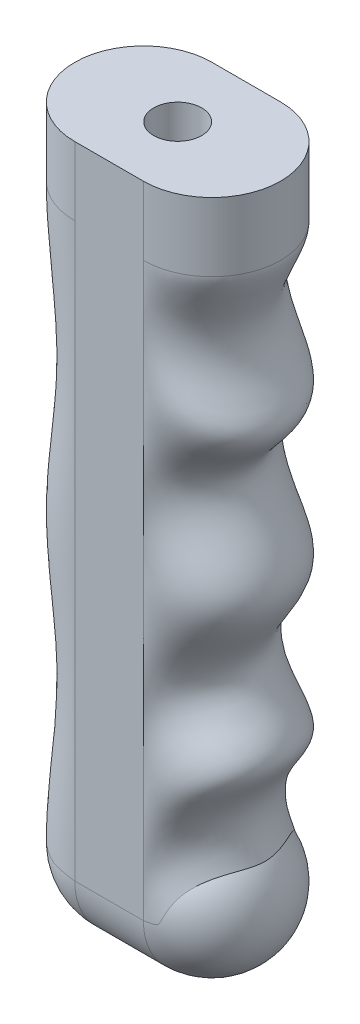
ISO-10303-21;
HEADER;
FILE_DESCRIPTION(('STEP AP214'),'2;1');
FILE_NAME('part.step','',(''),(''),'','','');
FILE_SCHEMA(('AUTOMOTIVE_DESIGN { 1 0 10303 214 1 1 1 1 }'));
ENDSEC;
DATA;
#1=APPLICATION_CONTEXT('core data for automotive mechanical design processes');
#2=APPLICATION_PROTOCOL_DEFINITION('international standard','automotive_design',2000,#1);
#3=PRODUCT_CONTEXT('',#1,'mechanical');
#4=PRODUCT('Part','Part','',(#3));
#5=PRODUCT_RELATED_PRODUCT_CATEGORY('part','',(#4));
#6=PRODUCT_DEFINITION_FORMATION('','',#4);
#7=PRODUCT_DEFINITION_CONTEXT('part definition',#1,'design');
#8=PRODUCT_DEFINITION('design','',#6,#7);
#9=PRODUCT_DEFINITION_SHAPE('','',#8);
#10=(LENGTH_UNIT() NAMED_UNIT(*) SI_UNIT(.MILLI.,.METRE.));
#11=(NAMED_UNIT(*) PLANE_ANGLE_UNIT() SI_UNIT($,.RADIAN.));
#12=(NAMED_UNIT(*) SI_UNIT($,.STERADIAN.) SOLID_ANGLE_UNIT());
#13=UNCERTAINTY_MEASURE_WITH_UNIT(LENGTH_MEASURE(1.E-05),#10,'distance_accuracy_value','');
#14=(GEOMETRIC_REPRESENTATION_CONTEXT(3) GLOBAL_UNCERTAINTY_ASSIGNED_CONTEXT((#13)) GLOBAL_UNIT_ASSIGNED_CONTEXT((#10,
#11,#12)) REPRESENTATION_CONTEXT('',''));
#15=CARTESIAN_POINT('',(0.,0.,0.));
#16=DIRECTION('',(0.,0.,1.));
#17=DIRECTION('',(1.,0.,0.));
#18=AXIS2_PLACEMENT_3D('',#15,#16,#17);
#19=CARTESIAN_POINT('',(-10.,125.,15.));
#20=CARTESIAN_POINT('',(-10.,113.883212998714,15.));
#21=CARTESIAN_POINT('',(-10.,93.0851912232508,15.));
#22=CARTESIAN_POINT('',(-10.,72.2547003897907,15.));
#23=CARTESIAN_POINT('',(-10.,62.5353115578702,15.));
#24=CARTESIAN_POINT('',(-10.,62.4646884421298,15.));
#25=CARTESIAN_POINT('',(-10.,52.7452996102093,15.));
#26=CARTESIAN_POINT('',(-10.,31.9148087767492,15.));
#27=CARTESIAN_POINT('',(-10.,11.116787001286,15.));
#28=CARTESIAN_POINT('',(-10.,0.,15.));
#29=CARTESIAN_POINT('',(-11.9634954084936,125.,15.));
#30=CARTESIAN_POINT('',(-11.9634954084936,113.883212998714,15.));
#31=CARTESIAN_POINT('',(-11.278796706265,93.0149864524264,14.4558071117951));
#32=CARTESIAN_POINT('',(-11.9639934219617,72.2547537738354,15.000395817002));
#33=CARTESIAN_POINT('',(-11.9634953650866,62.535311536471,14.9999999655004));
#34=CARTESIAN_POINT('',(-11.9634953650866,62.4646884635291,14.9999999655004));
#35=CARTESIAN_POINT('',(-11.9639934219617,52.7452462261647,15.000395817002));
#36=CARTESIAN_POINT('',(-11.278796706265,31.9850135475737,14.4558071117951));
#37=CARTESIAN_POINT('',(-11.9634954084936,11.116787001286,15.));
#38=CARTESIAN_POINT('',(-11.9634954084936,0.,15.));
#39=CARTESIAN_POINT('',(-13.9262182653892,125.,14.6095901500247));
#40=CARTESIAN_POINT('',(-13.9262182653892,113.883212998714,14.6095901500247));
#41=CARTESIAN_POINT('',(-12.6424081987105,92.9535572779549,13.6563408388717));
#42=CARTESIAN_POINT('',(-13.9271520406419,72.2548004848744,14.6102834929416));
#43=CARTESIAN_POINT('',(-13.926218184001,62.5353115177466,14.6095900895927));
#44=CARTESIAN_POINT('',(-13.926218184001,62.4646884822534,14.6095900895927));
#45=CARTESIAN_POINT('',(-13.9271520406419,52.7451995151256,14.6102834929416));
#46=CARTESIAN_POINT('',(-12.6424081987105,32.046442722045,13.6563408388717));
#47=CARTESIAN_POINT('',(-13.9262182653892,11.116787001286,14.6095901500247));
#48=CARTESIAN_POINT('',(-13.9262182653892,0.,14.6095901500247));
#49=CARTESIAN_POINT('',(-17.5542847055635,125.,13.1067958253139));
#50=CARTESIAN_POINT('',(-17.5542847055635,113.883212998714,13.1067958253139));
#51=CARTESIAN_POINT('',(-15.2434265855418,92.8482501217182,11.6070759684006));
#52=CARTESIAN_POINT('',(-17.5559655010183,72.2548805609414,13.1078866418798));
#53=CARTESIAN_POINT('',(-17.5542845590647,62.5353114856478,13.1067957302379));
#54=CARTESIAN_POINT('',(-17.5542845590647,62.4646885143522,13.1067957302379));
#55=CARTESIAN_POINT('',(-17.5559655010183,52.7451194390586,13.1078866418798));
#56=CARTESIAN_POINT('',(-15.2434265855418,32.1517498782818,11.6070759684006));
#57=CARTESIAN_POINT('',(-17.5542847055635,11.116787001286,13.1067958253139));
#58=CARTESIAN_POINT('',(-17.5542847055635,0.,13.1067958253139));
#59=CARTESIAN_POINT('',(-19.2182007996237,125.,11.9950026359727));
#60=CARTESIAN_POINT('',(-19.2182007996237,113.883212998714,11.9950026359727));
#61=CARTESIAN_POINT('',(-16.4794059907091,92.8043721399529,10.3578686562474));
#62=CARTESIAN_POINT('',(-19.2201928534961,72.2549139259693,11.9961934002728));
#63=CARTESIAN_POINT('',(-19.2182006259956,62.5353114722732,11.9950025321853));
#64=CARTESIAN_POINT('',(-19.2182006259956,62.4646885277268,11.9950025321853));
#65=CARTESIAN_POINT('',(-19.2201928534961,52.7450860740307,11.9961934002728));
#66=CARTESIAN_POINT('',(-16.4794059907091,32.1956278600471,10.3578686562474));
#67=CARTESIAN_POINT('',(-19.2182007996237,11.116787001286,11.9950026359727));
#68=CARTESIAN_POINT('',(-19.2182007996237,0.,11.9950026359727));
#69=CARTESIAN_POINT('',(-21.9950026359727,125.,9.21820079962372));
#70=CARTESIAN_POINT('',(-21.9950026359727,113.883212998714,9.21820079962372));
#71=CARTESIAN_POINT('',(-18.5715091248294,92.7341673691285,7.57925024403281));
#72=CARTESIAN_POINT('',(-21.9974927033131,72.2549673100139,9.21939288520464));
#73=CARTESIAN_POINT('',(-21.9950024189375,62.535311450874,9.2182006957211));
#74=CARTESIAN_POINT('',(-21.9950024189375,62.464688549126,9.2182006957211));
#75=CARTESIAN_POINT('',(-21.9974927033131,52.7450326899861,9.21939288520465));
#76=CARTESIAN_POINT('',(-18.5715091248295,32.2658326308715,7.57925024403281));
#77=CARTESIAN_POINT('',(-21.9950026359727,11.116787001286,9.21820079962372));
#78=CARTESIAN_POINT('',(-21.9950026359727,0.,9.21820079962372));
#79=CARTESIAN_POINT('',(-23.1067958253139,125.,7.5542847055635));
#80=CARTESIAN_POINT('',(-23.1067958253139,113.883212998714,7.5542847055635));
#81=CARTESIAN_POINT('',(-19.4265403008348,92.7078405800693,6.05093169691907));
#82=CARTESIAN_POINT('',(-23.1094726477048,72.2549873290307,7.55537816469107));
#83=CARTESIAN_POINT('',(-23.106795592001,62.5353114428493,7.5542846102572));
#84=CARTESIAN_POINT('',(-23.106795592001,62.4646885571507,7.5542846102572));
#85=CARTESIAN_POINT('',(-23.1094726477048,52.7450126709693,7.55537816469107));
#86=CARTESIAN_POINT('',(-19.4265403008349,32.2921594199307,6.05093169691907));
#87=CARTESIAN_POINT('',(-23.1067958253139,11.116787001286,7.5542847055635));
#88=CARTESIAN_POINT('',(-23.1067958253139,0.,7.5542847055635));
#89=CARTESIAN_POINT('',(-24.5701972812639,125.,4.02132106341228));
#90=CARTESIAN_POINT('',(-24.5701972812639,113.883212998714,4.02132106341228));
#91=CARTESIAN_POINT('',(-20.5565664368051,92.6736583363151,3.04924295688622));
#92=CARTESIAN_POINT('',(-24.5731165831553,72.2550133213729,4.02202810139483));
#93=CARTESIAN_POINT('',(-24.5701970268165,62.5353114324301,4.02132100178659));
#94=CARTESIAN_POINT('',(-24.5701970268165,62.4646885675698,4.02132100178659));
#95=CARTESIAN_POINT('',(-24.5731165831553,52.7449866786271,4.02202810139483));
#96=CARTESIAN_POINT('',(-20.5565664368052,32.3263416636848,3.04924295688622));
#97=CARTESIAN_POINT('',(-24.5701972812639,11.116787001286,4.02132106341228));
#98=CARTESIAN_POINT('',(-24.5701972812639,0.,4.02132106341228));
#99=CARTESIAN_POINT('',(-24.9713195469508,125.,2.10561645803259));
#100=CARTESIAN_POINT('',(-24.9713195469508,113.883212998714,2.10561645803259));
#101=CARTESIAN_POINT('',(-20.8694215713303,92.6646079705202,1.52824319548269));
#102=CARTESIAN_POINT('',(-24.9743030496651,72.2550202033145,2.10603640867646));
#103=CARTESIAN_POINT('',(-24.9713192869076,62.5353114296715,2.10561642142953));
#104=CARTESIAN_POINT('',(-24.9713192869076,62.4646885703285,2.10561642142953));
#105=CARTESIAN_POINT('',(-24.9743030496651,52.7449797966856,2.10603640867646));
#106=CARTESIAN_POINT('',(-20.8694215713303,32.3353920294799,1.52824319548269));
#107=CARTESIAN_POINT('',(-24.9713195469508,11.116787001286,2.10561645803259));
#108=CARTESIAN_POINT('',(-24.9713195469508,0.,2.10561645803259));
#109=CARTESIAN_POINT('',(-24.9995893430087,125.,0.142332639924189));
#110=CARTESIAN_POINT('',(-24.9995893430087,113.883212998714,0.142332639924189));
#111=CARTESIAN_POINT('',(-20.8914871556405,92.6639718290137,0.10281933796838));
#112=CARTESIAN_POINT('',(-25.0025773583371,72.2550206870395,0.142361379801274));
#113=CARTESIAN_POINT('',(-24.9995890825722,62.5353114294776,0.142332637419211));
#114=CARTESIAN_POINT('',(-24.9995890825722,62.4646885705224,0.142332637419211));
#115=CARTESIAN_POINT('',(-25.0025773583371,52.7449793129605,0.142361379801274));
#116=CARTESIAN_POINT('',(-20.8914871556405,32.3360281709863,0.102819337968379));
#117=CARTESIAN_POINT('',(-24.9995893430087,11.116787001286,0.142332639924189));
#118=CARTESIAN_POINT('',(-24.9995893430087,0.,0.142332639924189));
#119=CARTESIAN_POINT('',(-25.,125.,0.039394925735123));
#120=CARTESIAN_POINT('',(-25.,113.883212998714,0.039394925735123));
#121=CARTESIAN_POINT('',(-20.891807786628,92.663962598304,0.0284584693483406));
#122=CARTESIAN_POINT('',(-25.0029880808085,72.2550206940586,0.0394028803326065));
#123=CARTESIAN_POINT('',(-24.9999997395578,62.5353114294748,0.0393949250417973));
#124=CARTESIAN_POINT('',(-24.9999997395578,62.4646885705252,0.0393949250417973));
#125=CARTESIAN_POINT('',(-25.0029880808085,52.7449793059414,0.0394028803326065));
#126=CARTESIAN_POINT('',(-20.891807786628,32.336037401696,0.0284584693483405));
#127=CARTESIAN_POINT('',(-25.,11.116787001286,0.039394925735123));
#128=CARTESIAN_POINT('',(-25.,0.,0.039394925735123));
#129=CARTESIAN_POINT('',(-25.,125.,-0.0393949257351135));
#130=CARTESIAN_POINT('',(-25.,113.883212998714,-0.0393949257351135));
#131=CARTESIAN_POINT('',(-20.891807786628,92.663962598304,-0.0284584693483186));
#132=CARTESIAN_POINT('',(-25.0029880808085,72.2550206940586,-0.039402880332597));
#133=CARTESIAN_POINT('',(-24.9999997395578,62.5353114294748,-0.0393949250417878));
#134=CARTESIAN_POINT('',(-24.9999997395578,62.4646885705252,-0.0393949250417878));
#135=CARTESIAN_POINT('',(-25.0029880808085,52.7449793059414,-0.039402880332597));
#136=CARTESIAN_POINT('',(-20.891807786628,32.336037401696,-0.0284584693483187));
#137=CARTESIAN_POINT('',(-25.,11.116787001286,-0.0393949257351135));
#138=CARTESIAN_POINT('',(-25.,0.,-0.0393949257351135));
#139=CARTESIAN_POINT('',(-24.9995893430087,125.,-0.142332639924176));
#140=CARTESIAN_POINT('',(-24.9995893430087,113.883212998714,-0.142332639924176));
#141=CARTESIAN_POINT('',(-20.8914871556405,92.6639718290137,-0.102819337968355));
#142=CARTESIAN_POINT('',(-25.0025773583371,72.2550206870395,-0.142361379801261));
#143=CARTESIAN_POINT('',(-24.9995890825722,62.5353114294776,-0.142332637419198));
#144=CARTESIAN_POINT('',(-24.9995890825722,62.4646885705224,-0.142332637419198));
#145=CARTESIAN_POINT('',(-25.0025773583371,52.7449793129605,-0.142361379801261));
#146=CARTESIAN_POINT('',(-20.8914871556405,32.3360281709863,-0.102819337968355));
#147=CARTESIAN_POINT('',(-24.9995893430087,11.116787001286,-0.142332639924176));
#148=CARTESIAN_POINT('',(-24.9995893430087,0.,-0.142332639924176));
#149=CARTESIAN_POINT('',(-24.9713195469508,125.,-2.10561645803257));
#150=CARTESIAN_POINT('',(-24.9713195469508,113.883212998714,-2.10561645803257));
#151=CARTESIAN_POINT('',(-20.8694215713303,92.6646079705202,-1.52824319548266));
#152=CARTESIAN_POINT('',(-24.9743030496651,72.2550202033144,-2.10603640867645));
#153=CARTESIAN_POINT('',(-24.9713192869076,62.5353114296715,-2.10561642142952));
#154=CARTESIAN_POINT('',(-24.9713192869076,62.4646885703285,-2.10561642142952));
#155=CARTESIAN_POINT('',(-24.9743030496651,52.7449797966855,-2.10603640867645));
#156=CARTESIAN_POINT('',(-20.8694215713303,32.3353920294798,-1.52824319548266));
#157=CARTESIAN_POINT('',(-24.9713195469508,11.116787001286,-2.10561645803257));
#158=CARTESIAN_POINT('',(-24.9713195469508,0.,-2.10561645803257));
#159=CARTESIAN_POINT('',(-24.570197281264,125.,-4.02132106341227));
#160=CARTESIAN_POINT('',(-24.570197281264,113.883212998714,-4.02132106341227));
#161=CARTESIAN_POINT('',(-20.5565664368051,92.6736583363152,-3.0492429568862));
#162=CARTESIAN_POINT('',(-24.5731165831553,72.2550133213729,-4.02202810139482));
#163=CARTESIAN_POINT('',(-24.5701970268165,62.5353114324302,-4.02132100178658));
#164=CARTESIAN_POINT('',(-24.5701970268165,62.4646885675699,-4.02132100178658));
#165=CARTESIAN_POINT('',(-24.5731165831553,52.7449866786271,-4.02202810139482));
#166=CARTESIAN_POINT('',(-20.5565664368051,32.3263416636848,-3.0492429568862));
#167=CARTESIAN_POINT('',(-24.570197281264,11.116787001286,-4.02132106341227));
#168=CARTESIAN_POINT('',(-24.570197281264,0.,-4.02132106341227));
#169=CARTESIAN_POINT('',(-23.1067958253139,125.,-7.55428470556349));
#170=CARTESIAN_POINT('',(-23.1067958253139,113.883212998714,-7.55428470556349));
#171=CARTESIAN_POINT('',(-19.4265403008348,92.7078405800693,-6.05093169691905));
#172=CARTESIAN_POINT('',(-23.1094726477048,72.2549873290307,-7.55537816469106));
#173=CARTESIAN_POINT('',(-23.106795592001,62.5353114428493,-7.55428461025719));
#174=CARTESIAN_POINT('',(-23.106795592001,62.4646885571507,-7.55428461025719));
#175=CARTESIAN_POINT('',(-23.1094726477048,52.7450126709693,-7.55537816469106));
#176=CARTESIAN_POINT('',(-19.4265403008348,32.2921594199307,-6.05093169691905));
#177=CARTESIAN_POINT('',(-23.1067958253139,11.116787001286,-7.55428470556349));
#178=CARTESIAN_POINT('',(-23.1067958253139,0.,-7.55428470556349));
#179=CARTESIAN_POINT('',(-21.9950026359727,125.,-9.21820079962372));
#180=CARTESIAN_POINT('',(-21.9950026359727,113.883212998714,-9.21820079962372));
#181=CARTESIAN_POINT('',(-18.5715091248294,92.7341673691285,-7.5792502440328));
#182=CARTESIAN_POINT('',(-21.9974927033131,72.254967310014,-9.21939288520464));
#183=CARTESIAN_POINT('',(-21.9950024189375,62.535311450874,-9.2182006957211));
#184=CARTESIAN_POINT('',(-21.9950024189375,62.464688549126,-9.2182006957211));
#185=CARTESIAN_POINT('',(-21.9974927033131,52.7450326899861,-9.21939288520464));
#186=CARTESIAN_POINT('',(-18.5715091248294,32.2658326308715,-7.5792502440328));
#187=CARTESIAN_POINT('',(-21.9950026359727,11.116787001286,-9.21820079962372));
#188=CARTESIAN_POINT('',(-21.9950026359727,0.,-9.21820079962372));
#189=CARTESIAN_POINT('',(-19.2182007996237,125.,-11.9950026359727));
#190=CARTESIAN_POINT('',(-19.2182007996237,113.883212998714,-11.9950026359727));
#191=CARTESIAN_POINT('',(-16.4794059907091,92.8043721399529,-10.3578686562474));
#192=CARTESIAN_POINT('',(-19.2201928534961,72.2549139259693,-11.9961934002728));
#193=CARTESIAN_POINT('',(-19.2182006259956,62.5353114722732,-11.9950025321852));
#194=CARTESIAN_POINT('',(-19.2182006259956,62.4646885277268,-11.9950025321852));
#195=CARTESIAN_POINT('',(-19.220192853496,52.7450860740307,-11.9961934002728));
#196=CARTESIAN_POINT('',(-16.479405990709,32.195627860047,-10.3578686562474));
#197=CARTESIAN_POINT('',(-19.2182007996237,11.116787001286,-11.9950026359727));
#198=CARTESIAN_POINT('',(-19.2182007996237,0.,-11.9950026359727));
#199=CARTESIAN_POINT('',(-17.5542847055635,125.,-13.1067958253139));
#200=CARTESIAN_POINT('',(-17.5542847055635,113.883212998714,-13.1067958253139));
#201=CARTESIAN_POINT('',(-15.2434265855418,92.8482501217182,-11.6070759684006));
#202=CARTESIAN_POINT('',(-17.5559655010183,72.2548805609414,-13.1078866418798));
#203=CARTESIAN_POINT('',(-17.5542845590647,62.5353114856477,-13.1067957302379));
#204=CARTESIAN_POINT('',(-17.5542845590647,62.4646885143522,-13.1067957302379));
#205=CARTESIAN_POINT('',(-17.5559655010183,52.7451194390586,-13.1078866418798));
#206=CARTESIAN_POINT('',(-15.2434265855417,32.1517498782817,-11.6070759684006));
#207=CARTESIAN_POINT('',(-17.5542847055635,11.116787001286,-13.1067958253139));
#208=CARTESIAN_POINT('',(-17.5542847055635,0.,-13.1067958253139));
#209=CARTESIAN_POINT('',(-13.9262182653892,125.,-14.6095901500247));
#210=CARTESIAN_POINT('',(-13.9262182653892,113.883212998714,-14.6095901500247));
#211=CARTESIAN_POINT('',(-12.6424081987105,92.953557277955,-13.6563408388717));
#212=CARTESIAN_POINT('',(-13.9271520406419,72.2548004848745,-14.6102834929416));
#213=CARTESIAN_POINT('',(-13.926218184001,62.5353115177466,-14.6095900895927));
#214=CARTESIAN_POINT('',(-13.926218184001,62.4646884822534,-14.6095900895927));
#215=CARTESIAN_POINT('',(-13.9271520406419,52.7451995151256,-14.6102834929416));
#216=CARTESIAN_POINT('',(-12.6424081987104,32.0464427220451,-13.6563408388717));
#217=CARTESIAN_POINT('',(-13.9262182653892,11.116787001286,-14.6095901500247));
#218=CARTESIAN_POINT('',(-13.9262182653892,0.,-14.6095901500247));
#219=CARTESIAN_POINT('',(-11.9634954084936,125.,-15.));
#220=CARTESIAN_POINT('',(-11.9634954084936,113.883212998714,-15.));
#221=CARTESIAN_POINT('',(-11.2787967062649,93.0149864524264,-14.4558071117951));
#222=CARTESIAN_POINT('',(-11.9639934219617,72.2547537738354,-15.000395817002));
#223=CARTESIAN_POINT('',(-11.9634953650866,62.5353115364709,-14.9999999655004));
#224=CARTESIAN_POINT('',(-11.9634953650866,62.4646884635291,-14.9999999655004));
#225=CARTESIAN_POINT('',(-11.9639934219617,52.7452462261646,-15.000395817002));
#226=CARTESIAN_POINT('',(-11.2787967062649,31.9850135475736,-14.4558071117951));
#227=CARTESIAN_POINT('',(-11.9634954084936,11.116787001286,-15.));
#228=CARTESIAN_POINT('',(-11.9634954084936,0.,-15.));
#229=CARTESIAN_POINT('',(-10.,125.,-15.));
#230=CARTESIAN_POINT('',(-10.,113.883212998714,-15.));
#231=CARTESIAN_POINT('',(-10.,93.0851912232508,-15.));
#232=CARTESIAN_POINT('',(-10.,72.2547003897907,-15.));
#233=CARTESIAN_POINT('',(-10.,62.5353115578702,-15.));
#234=CARTESIAN_POINT('',(-10.,62.4646884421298,-15.));
#235=CARTESIAN_POINT('',(-10.,52.7452996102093,-15.));
#236=CARTESIAN_POINT('',(-10.,31.9148087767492,-15.));
#237=CARTESIAN_POINT('',(-10.,11.116787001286,-15.));
#238=CARTESIAN_POINT('',(-10.,0.,-15.));
#239=B_SPLINE_SURFACE_WITH_KNOTS('',3,3,((#19,#20,#21,#22,#23,#24,#25,#26,#27,#28),(#29,#30,#31,
#32,#33,#34,#35,#36,#37,#38),(#39,#40,#41,#42,#43,#44,#45,#46,#47,#48),(#49,#50,#51,#52,#53,#54,
#55,#56,#57,#58),(#59,#60,#61,#62,#63,#64,#65,#66,#67,#68),(#69,#70,#71,#72,#73,#74,#75,#76,#77,
#78),(#79,#80,#81,#82,#83,#84,#85,#86,#87,#88),(#89,#90,#91,#92,#93,#94,#95,#96,#97,#98),(#99,
#100,#101,#102,#103,#104,#105,#106,#107,#108),(#109,#110,#111,#112,#113,#114,#115,#116,#117,
#118),(#119,#120,#121,#122,#123,#124,#125,#126,#127,#128),(#129,#130,#131,#132,#133,#134,#135,
#136,#137,#138),(#139,#140,#141,#142,#143,#144,#145,#146,#147,#148),(#149,#150,#151,#152,#153,
#154,#155,#156,#157,#158),(#159,#160,#161,#162,#163,#164,#165,#166,#167,#168),(#169,#170,#171,
#172,#173,#174,#175,#176,#177,#178),(#179,#180,#181,#182,#183,#184,#185,#186,#187,#188),(#189,
#190,#191,#192,#193,#194,#195,#196,#197,#198),(#199,#200,#201,#202,#203,#204,#205,#206,#207,
#208),(#209,#210,#211,#212,#213,#214,#215,#216,#217,#218),(#219,#220,#221,#222,#223,#224,#225,
#226,#227,#228),(#229,#230,#231,#232,#233,#234,#235,#236,#237,#238)),.UNSPECIFIED.,.F.,.F.,.F.,
(4,2,2,2,1,1,2,1,1,2,2,2,4),(4,1,1,1,1,1,1,4),(0.,0.125,0.25,0.375,0.493446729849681,
0.497492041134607,0.5,0.502507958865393,0.506553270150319,0.625,0.75,0.875,1.),(0.,
0.266802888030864,0.499152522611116,0.499931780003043,0.500068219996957,0.500847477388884,
0.733197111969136,1.),.UNSPECIFIED.);
#240=CARTESIAN_POINT('',(-10.0000000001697,0.,-15.));
#241=CARTESIAN_POINT('',(-10.0721268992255,0.00811400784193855,-15.0000007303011));
#242=CARTESIAN_POINT('',(-10.1442913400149,0.0159518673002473,-14.9994736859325));
#243=CARTESIAN_POINT('',(-10.5798295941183,0.0615529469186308,-14.9931126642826));
#244=CARTESIAN_POINT('',(-10.9438518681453,0.092517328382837,-14.9744481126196));
#245=CARTESIAN_POINT('',(-11.6707265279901,0.139473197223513,-14.9105006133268));
#246=CARTESIAN_POINT('',(-12.0335779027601,0.155454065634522,-14.8651988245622));
#247=CARTESIAN_POINT('',(-12.7555427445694,0.171811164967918,-14.7482646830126));
#248=CARTESIAN_POINT('',(-13.1146544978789,0.172180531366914,-14.6766207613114));
#249=CARTESIAN_POINT('',(-13.8262025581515,0.156911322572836,-14.5075564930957));
#250=CARTESIAN_POINT('',(-14.1786433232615,0.141283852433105,-14.4101540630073));
#251=CARTESIAN_POINT('',(-14.6978310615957,0.105966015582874,-14.2461088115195));
#252=CARTESIAN_POINT('',(-14.868061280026,0.0923605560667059,-14.1889353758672));
#253=CARTESIAN_POINT('',(-15.2059039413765,0.0612788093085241,-14.0686586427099));
#254=CARTESIAN_POINT('',(-15.3735185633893,0.0438059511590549,-14.0055606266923));
#255=CARTESIAN_POINT('',(-15.6068050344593,0.0165874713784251,-13.9128982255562));
#256=CARTESIAN_POINT('',(-15.6736475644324,0.0084494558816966,-13.8857815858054));
#257=CARTESIAN_POINT('',(-15.7402514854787,0.,-13.8581929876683));
#258=B_SPLINE_CURVE_WITH_KNOTS('',3,(#240,#241,#242,#243,#244,#245,#246,#247,#248,#249,#250,
#251,#252,#253,#254,#255,#256,#257),.UNSPECIFIED.,.F.,.F.,(4,2,2,2,2,2,2,2,4),(0.,
0.217761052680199,1.31378079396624,2.41057670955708,3.50785489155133,4.60437185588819,
5.14451463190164,5.68418038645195,5.90194186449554),.UNSPECIFIED.);
#259=CARTESIAN_POINT('',(-15.7402514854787,0.,-13.8581929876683));
#260=VERTEX_POINT('',#259);
#261=CARTESIAN_POINT('',(-9.99999999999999,0.,-15.));
#262=VERTEX_POINT('',#261);
#263=EDGE_CURVE('E275',#260,#262,#258,.F.);
#264=CARTESIAN_POINT('',(-15.7402514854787,0.,-13.8581929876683));
#265=CARTESIAN_POINT('',(-15.8068527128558,0.00844940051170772,-13.8306066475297));
#266=CARTESIAN_POINT('',(-15.8732889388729,0.0166135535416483,-13.8025173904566));
#267=CARTESIAN_POINT('',(-16.2697277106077,0.063729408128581,-13.6314791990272));
#268=CARTESIAN_POINT('',(-16.5955599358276,0.0957905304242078,-13.4766567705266));
#269=CARTESIAN_POINT('',(-17.236282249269,0.14460314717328,-13.1433047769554));
#270=CARTESIAN_POINT('',(-17.5511645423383,0.161343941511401,-12.9647587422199));
#271=CARTESIAN_POINT('',(-18.1677576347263,0.178834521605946,-12.5851877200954));
#272=CARTESIAN_POINT('',(-18.4694621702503,0.179576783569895,-12.3841522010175));
#273=CARTESIAN_POINT('',(-19.0572054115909,0.164695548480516,-11.9612251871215));
#274=CARTESIAN_POINT('',(-19.3432546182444,0.149083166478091,-11.7393479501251));
#275=CARTESIAN_POINT('',(-19.7641053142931,0.11299132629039,-11.3879185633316));
#276=CARTESIAN_POINT('',(-19.9053735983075,0.0984814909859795,-11.2653921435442));
#277=CARTESIAN_POINT('',(-20.1828177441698,0.065133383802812,-11.0154920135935));
#278=CARTESIAN_POINT('',(-20.3189981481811,0.0462990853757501,-10.8881228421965));
#279=CARTESIAN_POINT('',(-20.504299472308,0.0172071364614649,-10.7081591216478));
#280=CARTESIAN_POINT('',(-20.5556519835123,0.00876271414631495,-10.6575519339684));
#281=CARTESIAN_POINT('',(-20.6066017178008,0.,-10.6066017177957));
#282=B_SPLINE_CURVE_WITH_KNOTS('',3,(#264,#265,#266,#267,#268,#269,#270,#271,#272,#273,#274,
#275,#276,#277,#278,#279,#280,#281),.UNSPECIFIED.,.F.,.F.,(4,2,2,2,2,2,2,2,4),(0.,
0.217761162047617,1.30285805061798,2.38871222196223,3.4750770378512,4.56070401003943,
5.12324624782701,5.68527365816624,5.9030352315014),.UNSPECIFIED.);
#283=CARTESIAN_POINT('',(-20.6066017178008,0.,-10.6066017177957));
#284=VERTEX_POINT('',#283);
#285=EDGE_CURVE('E327',#284,#260,#282,.F.);
#286=CARTESIAN_POINT('',(-20.6066017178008,0.,-10.6066017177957));
#287=CARTESIAN_POINT('',(-20.6575499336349,0.00876280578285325,-10.5556545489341));
#288=CARTESIAN_POINT('',(-20.7081554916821,0.0172253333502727,-10.5043036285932));
#289=CARTESIAN_POINT('',(-21.0070105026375,0.0657419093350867,-10.1965815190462));
#290=CARTESIAN_POINT('',(-21.2470381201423,0.0986606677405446,-9.93092985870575));
#291=CARTESIAN_POINT('',(-21.7082579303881,0.14873261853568,-9.38210149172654));
#292=CARTESIAN_POINT('',(-21.9294368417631,0.165874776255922,-9.09891266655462));
#293=CARTESIAN_POINT('',(-22.3513800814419,0.183846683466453,-8.51697858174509));
#294=CARTESIAN_POINT('',(-22.5521333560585,0.184667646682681,-8.21822502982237));
#295=CARTESIAN_POINT('',(-22.9315312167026,0.169797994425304,-7.60761441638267));
#296=CARTESIAN_POINT('',(-23.1101904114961,0.154118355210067,-7.29576619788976));
#297=CARTESIAN_POINT('',(-23.3668431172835,0.117514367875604,-6.80815314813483));
#298=CARTESIAN_POINT('',(-23.4531377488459,0.102382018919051,-6.6362513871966));
#299=CARTESIAN_POINT('',(-23.6187851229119,0.0675145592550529,-6.28977380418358));
#300=CARTESIAN_POINT('',(-23.6981443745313,0.0477838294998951,-6.1152006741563));
#301=CARTESIAN_POINT('',(-23.8025567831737,0.0175185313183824,-5.87319290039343));
#302=CARTESIAN_POINT('',(-23.8306267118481,0.0089177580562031,-5.80680327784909));
#303=CARTESIAN_POINT('',(-23.8581929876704,0.,-5.74025148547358));
#304=B_SPLINE_CURVE_WITH_KNOTS('',3,(#286,#287,#288,#289,#290,#291,#292,#293,#294,#295,#296,
#297,#298,#299,#300,#301,#302,#303),.UNSPECIFIED.,.F.,.F.,(4,2,2,2,2,2,2,2,4),(0.,
0.21776134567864,1.29497057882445,2.37293267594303,3.45147506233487,4.52930045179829,
5.10795797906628,5.68606644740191,5.90382800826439),.UNSPECIFIED.);
#305=CARTESIAN_POINT('',(-23.8581929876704,0.,-5.74025148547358));
#306=VERTEX_POINT('',#305);
#307=EDGE_CURVE('E319',#306,#284,#304,.F.);
#308=CARTESIAN_POINT('',(-23.8581929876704,0.,-5.74025148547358));
#309=CARTESIAN_POINT('',(-23.8857591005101,0.00891795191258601,-5.67370296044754));
#310=CARTESIAN_POINT('',(-23.9128549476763,0.017523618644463,-5.60691054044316));
#311=CARTESIAN_POINT('',(-24.0708252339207,0.0667179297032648,-5.2091874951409));
#312=CARTESIAN_POINT('',(-24.1906293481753,0.0999464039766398,-4.87281733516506));
#313=CARTESIAN_POINT('',(-24.4062710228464,0.150346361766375,-4.19110250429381));
#314=CARTESIAN_POINT('',(-24.5020915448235,0.167506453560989,-3.84575164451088));
#315=CARTESIAN_POINT('',(-24.6690585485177,0.185407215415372,-3.14849271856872));
#316=CARTESIAN_POINT('',(-24.7401902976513,0.186138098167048,-2.79658086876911));
#317=CARTESIAN_POINT('',(-24.8571450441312,0.171134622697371,-2.0891224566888));
#318=CARTESIAN_POINT('',(-24.902984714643,0.155411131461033,-1.733578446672));
#319=CARTESIAN_POINT('',(-24.9540023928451,0.118692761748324,-1.18393749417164));
#320=CARTESIAN_POINT('',(-24.9681897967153,0.103381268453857,-0.990235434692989));
#321=CARTESIAN_POINT('',(-24.9889819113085,0.068091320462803,-0.60301924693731));
#322=CARTESIAN_POINT('',(-24.9955939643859,0.0481174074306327,-0.409505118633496));
#323=CARTESIAN_POINT('',(-24.9994733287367,0.0175568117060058,-0.144108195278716));
#324=CARTESIAN_POINT('',(-25.0000003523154,0.00893590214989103,-0.0720327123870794));
#325=CARTESIAN_POINT('',(-25.,1.20402587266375E-13,9.68762176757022E-11));
#326=B_SPLINE_CURVE_WITH_KNOTS('',3,(#308,#309,#310,#311,#312,#313,#314,#315,#316,#317,#318,
#319,#320,#321,#322,#323,#324,#325),.UNSPECIFIED.,.F.,.F.,(4,2,2,2,2,2,2,2,4),(0.,
0.217761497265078,1.29217747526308,2.36735458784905,3.44317219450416,4.51827974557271,
5.10258190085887,5.68631724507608,5.90407878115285),.UNSPECIFIED.);
#327=CARTESIAN_POINT('',(-25.,0.,9.68762176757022E-11));
#328=VERTEX_POINT('',#327);
#329=EDGE_CURVE('E311',#328,#306,#326,.F.);
#330=CARTESIAN_POINT('',(-23.8581929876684,0.,5.74025148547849));
#331=CARTESIAN_POINT('',(-23.8857591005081,0.0089179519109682,5.67370296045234));
#332=CARTESIAN_POINT('',(-23.9128549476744,0.0175236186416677,5.6069105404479));
#333=CARTESIAN_POINT('',(-24.0708252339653,0.0667179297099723,5.2091874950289));
#334=CARTESIAN_POINT('',(-24.190629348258,0.0999464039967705,4.87281733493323));
#335=CARTESIAN_POINT('',(-24.4062710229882,0.150346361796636,4.19110250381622));
#336=CARTESIAN_POINT('',(-24.5020915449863,0.16750645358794,3.84575164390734));
#337=CARTESIAN_POINT('',(-24.669058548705,0.185407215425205,3.14849271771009));
#338=CARTESIAN_POINT('',(-24.7401902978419,0.186138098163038,2.79658086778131));
#339=CARTESIAN_POINT('',(-24.85714504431,0.171134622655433,2.08912245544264));
#340=CARTESIAN_POINT('',(-24.9029847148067,0.155411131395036,1.73357844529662));
#341=CARTESIAN_POINT('',(-24.9540023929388,0.118692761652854,1.18393749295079));
#342=CARTESIAN_POINT('',(-24.9681897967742,0.103381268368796,0.990235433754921));
#343=CARTESIAN_POINT('',(-24.98898191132,0.0680913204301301,0.603019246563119));
#344=CARTESIAN_POINT('',(-24.9955939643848,0.0481174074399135,0.409505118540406));
#345=CARTESIAN_POINT('',(-24.9994733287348,0.0175568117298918,0.144108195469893));
#346=CARTESIAN_POINT('',(-25.0000003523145,0.00893590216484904,0.0720327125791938));
#347=CARTESIAN_POINT('',(-25.,1.20402587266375E-13,9.68762176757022E-11));
#348=B_SPLINE_CURVE_WITH_KNOTS('',3,(#330,#331,#332,#333,#334,#335,#336,#337,#338,#339,#340,
#341,#342,#343,#344,#345,#346,#347),.UNSPECIFIED.,.F.,.F.,(4,2,2,2,2,2,2,2,4),(0.,
0.217761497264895,1.2921774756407,2.36735458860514,3.44317219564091,4.51827974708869,
5.10258190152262,5.68631724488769,5.90407878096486),.UNSPECIFIED.);
#349=CARTESIAN_POINT('',(-23.8581929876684,0.,5.74025148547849));
#350=VERTEX_POINT('',#349);
#351=EDGE_CURVE('E303',#350,#328,#348,.T.);
#352=CARTESIAN_POINT('',(-23.8581929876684,0.,5.74025148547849));
#353=CARTESIAN_POINT('',(-23.8306282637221,0.00891793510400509,5.80680059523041));
#354=CARTESIAN_POINT('',(-23.8025583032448,0.0175186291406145,5.87319021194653));
#355=CARTESIAN_POINT('',(-23.6326670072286,0.0667606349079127,6.26696042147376));
#356=CARTESIAN_POINT('',(-23.479104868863,0.0998978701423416,6.59034928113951));
#357=CARTESIAN_POINT('',(-23.1485736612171,0.149930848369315,7.2264637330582));
#358=CARTESIAN_POINT('',(-22.9715879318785,0.166814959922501,7.53918153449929));
#359=CARTESIAN_POINT('',(-22.5954262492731,0.184104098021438,8.15172799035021));
#360=CARTESIAN_POINT('',(-22.3962363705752,0.184498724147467,8.45154839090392));
#361=CARTESIAN_POINT('',(-21.9772951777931,0.168921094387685,9.03576284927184));
#362=CARTESIAN_POINT('',(-21.7575574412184,0.152959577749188,9.32016690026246));
#363=CARTESIAN_POINT('',(-21.4052705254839,0.116271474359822,9.74389751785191));
#364=CARTESIAN_POINT('',(-21.2794757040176,0.101175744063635,9.88940954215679));
#365=CARTESIAN_POINT('',(-21.0227481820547,0.0665592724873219,10.1750534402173));
#366=CARTESIAN_POINT('',(-20.8918205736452,0.0470428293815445,10.3151903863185));
#367=CARTESIAN_POINT('',(-20.7081573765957,0.0172252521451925,10.5043012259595));
#368=CARTESIAN_POINT('',(-20.657551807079,0.00876265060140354,10.5556521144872));
#369=CARTESIAN_POINT('',(-20.6066017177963,0.,10.6066017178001));
#370=B_SPLINE_CURVE_WITH_KNOTS('',3,(#352,#353,#354,#355,#356,#357,#358,#359,#360,#361,#362,
#363,#364,#365,#366,#367,#368,#369),.UNSPECIFIED.,.F.,.F.,(4,2,2,2,2,2,2,2,4),(0.,
0.21776156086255,1.29490544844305,2.37281961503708,3.45141364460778,4.52929993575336,
5.10796085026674,5.68606154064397,5.90382288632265),.UNSPECIFIED.);
#371=CARTESIAN_POINT('',(-20.6066017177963,0.,10.6066017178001));
#372=VERTEX_POINT('',#371);
#373=EDGE_CURVE('E295',#372,#350,#370,.F.);
#374=CARTESIAN_POINT('',(-20.6066017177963,0.,10.6066017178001));
#375=CARTESIAN_POINT('',(-20.5556545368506,0.00876295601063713,10.6575499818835));
#376=CARTESIAN_POINT('',(-20.5043020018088,0.0172072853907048,10.7081571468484));
#377=CARTESIAN_POINT('',(-20.1947190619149,0.0658079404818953,11.0088196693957));
#378=CARTESIAN_POINT('',(-19.9270377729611,0.0983323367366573,11.2505592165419));
#379=CARTESIAN_POINT('',(-19.3739202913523,0.147068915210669,11.7149104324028));
#380=CARTESIAN_POINT('',(-19.0884713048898,0.163269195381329,11.9375080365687));
#381=CARTESIAN_POINT('',(-18.5018217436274,0.179327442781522,12.361961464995));
#382=CARTESIAN_POINT('',(-18.200610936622,0.179174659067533,12.5638035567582));
#383=CARTESIAN_POINT('',(-17.5849359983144,0.16283268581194,12.9450094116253));
#384=CARTESIAN_POINT('',(-17.2704807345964,0.146654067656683,13.1243879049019));
#385=CARTESIAN_POINT('',(-16.7847213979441,0.110445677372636,13.3787355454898));
#386=CARTESIAN_POINT('',(-16.6174563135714,0.09602869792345,13.4623636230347));
#387=CARTESIAN_POINT('',(-16.2803703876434,0.0632102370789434,13.6230699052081));
#388=CARTESIAN_POINT('',(-16.1105521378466,0.0448125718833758,13.7001542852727));
#389=CARTESIAN_POINT('',(-15.8732916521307,0.0166135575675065,13.8025158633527));
#390=CARTESIAN_POINT('',(-15.8068554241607,0.00844935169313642,13.8306050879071));
#391=CARTESIAN_POINT('',(-15.740251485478,0.,13.8581929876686));
#392=B_SPLINE_CURVE_WITH_KNOTS('',3,(#374,#375,#376,#377,#378,#379,#380,#381,#382,#383,#384,
#385,#386,#387,#388,#389,#390,#391),.UNSPECIFIED.,.F.,.F.,(4,2,2,2,2,2,2,2,4),(0.,
0.217761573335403,1.30272984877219,2.38848861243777,3.4749611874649,4.56071755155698,
5.12325910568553,5.68526373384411,5.90302489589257),.UNSPECIFIED.);
#393=CARTESIAN_POINT('',(-15.740251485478,0.,13.8581929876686));
#394=VERTEX_POINT('',#393);
#395=EDGE_CURVE('E279',#394,#372,#392,.F.);
#396=CARTESIAN_POINT('',(-10.0000000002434,0.,15.));
#397=CARTESIAN_POINT('',(-10.072126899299,0.00811400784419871,15.0000007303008));
#398=CARTESIAN_POINT('',(-10.1442913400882,0.0159518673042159,14.9994736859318));
#399=CARTESIAN_POINT('',(-10.5798295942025,0.061552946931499,14.9931126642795));
#400=CARTESIAN_POINT('',(-10.9438518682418,0.0925173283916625,14.9744481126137));
#401=CARTESIAN_POINT('',(-11.6707265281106,0.139473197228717,14.9105006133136));
#402=CARTESIAN_POINT('',(-12.0335779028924,0.155454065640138,14.8651988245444));
#403=CARTESIAN_POINT('',(-12.7555427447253,0.171811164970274,14.7482646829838));
#404=CARTESIAN_POINT('',(-13.1146544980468,0.172180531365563,14.6766207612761));
#405=CARTESIAN_POINT('',(-13.8262025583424,0.156911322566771,14.5075564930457));
#406=CARTESIAN_POINT('',(-14.1786433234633,0.141283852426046,14.4101540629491));
#407=CARTESIAN_POINT('',(-14.697831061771,0.105966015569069,14.2461088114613));
#408=CARTESIAN_POINT('',(-14.8680612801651,0.0923605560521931,14.188935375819));
#409=CARTESIAN_POINT('',(-15.2059039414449,0.0612788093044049,14.0686586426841));
#410=CARTESIAN_POINT('',(-15.3735185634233,0.0438059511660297,14.0055606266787));
#411=CARTESIAN_POINT('',(-15.6068050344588,0.0165874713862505,13.9128982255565));
#412=CARTESIAN_POINT('',(-15.6736475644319,0.00844945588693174,13.8857815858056));
#413=CARTESIAN_POINT('',(-15.740251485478,0.,13.8581929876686));
#414=B_SPLINE_CURVE_WITH_KNOTS('',3,(#396,#397,#398,#399,#400,#401,#402,#403,#404,#405,#406,
#407,#408,#409,#410,#411,#412,#413),.UNSPECIFIED.,.F.,.F.,(4,2,2,2,2,2,2,2,4),(0.,
0.217761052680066,1.31378079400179,2.41057670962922,3.50785489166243,4.60437185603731,
5.1445146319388,5.6841803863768,5.90194186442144),.UNSPECIFIED.);
#415=CARTESIAN_POINT('',(-10.,0.,15.));
#416=VERTEX_POINT('',#415);
#417=EDGE_CURVE('E272',#416,#394,#414,.T.);
#418=DIRECTION('',(0.,-1.,0.));
#419=VECTOR('',#418,1.);
#420=CARTESIAN_POINT('',(-10.,125.,15.));
#421=LINE('',#420,#419);
#422=CARTESIAN_POINT('',(-10.,125.,15.));
#423=VERTEX_POINT('',#422);
#424=EDGE_CURVE('E14',#423,#416,#421,.T.);
#425=CARTESIAN_POINT('',(-10.,125.,0.));
#426=DIRECTION('',(0.,-1.,0.));
#427=DIRECTION('',(0.,0.,1.));
#428=AXIS2_PLACEMENT_3D('',#425,#426,#427);
#429=CIRCLE('',#428,15.);
#430=CARTESIAN_POINT('',(-10.,125.,-15.));
#431=VERTEX_POINT('',#430);
#432=EDGE_CURVE('E356',#431,#423,#429,.F.);
#433=DIRECTION('',(0.,-1.,0.));
#434=VECTOR('',#433,1.);
#435=CARTESIAN_POINT('',(-10.,125.,-15.));
#436=LINE('',#435,#434);
#437=EDGE_CURVE('E401',#431,#262,#436,.T.);
#438=ORIENTED_EDGE('',*,*,#263,.F.);
#439=ORIENTED_EDGE('',*,*,#285,.F.);
#440=ORIENTED_EDGE('',*,*,#307,.F.);
#441=ORIENTED_EDGE('',*,*,#329,.F.);
#442=ORIENTED_EDGE('',*,*,#351,.F.);
#443=ORIENTED_EDGE('',*,*,#373,.F.);
#444=ORIENTED_EDGE('',*,*,#395,.F.);
#445=ORIENTED_EDGE('',*,*,#417,.F.);
#446=ORIENTED_EDGE('',*,*,#424,.F.);
#447=ORIENTED_EDGE('',*,*,#432,.F.);
#448=ORIENTED_EDGE('',*,*,#437,.T.);
#449=EDGE_LOOP('',(#438,#439,#440,#441,#442,#443,#444,#445,#446,#447,#448));
#450=FACE_BOUND('',#449,.T.);
#451=ADVANCED_FACE('F124',(#450),#239,.T.);
#452=CARTESIAN_POINT('',(5.,125.,-15.));
#453=CARTESIAN_POINT('',(5.,122.27582064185,-15.));
#454=CARTESIAN_POINT('',(5.,114.014785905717,-15.));
#455=CARTESIAN_POINT('',(5.,100.159220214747,-15.));
#456=CARTESIAN_POINT('',(5.,82.0500662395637,-15.));
#457=CARTESIAN_POINT('',(5.,62.5,-15.));
#458=CARTESIAN_POINT('',(5.,42.9499337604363,-15.));
#459=CARTESIAN_POINT('',(5.,24.8407797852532,-15.));
#460=CARTESIAN_POINT('',(5.,10.9852140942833,-15.));
#461=CARTESIAN_POINT('',(5.,2.72417935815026,-15.));
#462=CARTESIAN_POINT('',(5.,0.,-15.));
#463=CARTESIAN_POINT('',(6.96349540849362,125.,-15.));
#464=CARTESIAN_POINT('',(6.96349540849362,122.27582064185,-15.));
#465=CARTESIAN_POINT('',(5.23611341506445,112.512717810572,-13.626816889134));
#466=CARTESIAN_POINT('',(8.27633058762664,99.1339279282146,-16.0436389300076));
#467=CARTESIAN_POINT('',(4.61773776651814,81.8955227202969,-13.1352388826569));
#468=CARTESIAN_POINT('',(8.49402597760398,62.5,-16.2166959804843));
#469=CARTESIAN_POINT('',(4.61773776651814,43.1044772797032,-13.1352388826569));
#470=CARTESIAN_POINT('',(8.27633058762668,25.8660720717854,-16.0436389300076));
#471=CARTESIAN_POINT('',(5.23611341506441,12.4872821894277,-13.626816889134));
#472=CARTESIAN_POINT('',(6.96349540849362,2.72417935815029,-15.));
#473=CARTESIAN_POINT('',(6.96349540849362,0.,-15.));
#474=CARTESIAN_POINT('',(8.92621826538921,125.,-14.6095901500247));
#475=CARTESIAN_POINT('',(8.9262182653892,122.27582064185,-14.6095901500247));
#476=CARTESIAN_POINT('',(5.68737702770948,111.198408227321,-12.2049301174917));
#477=CARTESIAN_POINT('',(11.3877842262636,98.236797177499,-16.437166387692));
#478=CARTESIAN_POINT('',(4.52792268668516,81.7602971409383,-11.3440995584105));
#479=CARTESIAN_POINT('',(11.7959630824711,62.5,-16.740216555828));
#480=CARTESIAN_POINT('',(4.52792268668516,43.2397028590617,-11.3440995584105));
#481=CARTESIAN_POINT('',(11.3877842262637,26.7632028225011,-16.437166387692));
#482=CARTESIAN_POINT('',(5.68737702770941,13.801591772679,-12.2049301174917));
#483=CARTESIAN_POINT('',(8.9262182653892,2.72417935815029,-14.6095901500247));
#484=CARTESIAN_POINT('',(8.92621826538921,0.,-14.6095901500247));
#485=CARTESIAN_POINT('',(12.5542847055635,125.,-13.1067958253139));
#486=CARTESIAN_POINT('',(12.5542847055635,122.27582064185,-13.1067958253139));
#487=CARTESIAN_POINT('',(6.72437047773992,108.945306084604,-9.32498079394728));
#488=CARTESIAN_POINT('',(16.9851034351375,96.6988587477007,-15.9810296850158));
#489=CARTESIAN_POINT('',(4.63735266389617,81.528481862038,-7.97115035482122));
#490=CARTESIAN_POINT('',(17.719825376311,62.5,-16.4576374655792));
#491=CARTESIAN_POINT('',(4.63735266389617,43.471518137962,-7.97115035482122));
#492=CARTESIAN_POINT('',(16.9851034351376,28.3011412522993,-15.9810296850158));
#493=CARTESIAN_POINT('',(6.72437047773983,16.0546939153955,-9.32498079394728));
#494=CARTESIAN_POINT('',(12.5542847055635,2.72417935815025,-13.1067958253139));
#495=CARTESIAN_POINT('',(12.5542847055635,0.,-13.1067958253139));
#496=CARTESIAN_POINT('',(14.2182007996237,125.,-11.9950026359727));
#497=CARTESIAN_POINT('',(14.2182007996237,122.27582064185,-11.9950026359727));
#498=CARTESIAN_POINT('',(7.30867282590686,108.006513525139,-7.86750952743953));
#499=CARTESIAN_POINT('',(19.4695415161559,96.0580510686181,-15.1319568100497));
#500=CARTESIAN_POINT('',(4.8351702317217,81.4318921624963,-6.38993176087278));
#501=CARTESIAN_POINT('',(20.3403230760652,62.5,-15.6521290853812));
#502=CARTESIAN_POINT('',(4.83517023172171,43.5681078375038,-6.38993176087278));
#503=CARTESIAN_POINT('',(19.469541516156,28.941948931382,-15.1319568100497));
#504=CARTESIAN_POINT('',(7.30867282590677,16.9934864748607,-7.86750952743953));
#505=CARTESIAN_POINT('',(14.2182007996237,2.72417935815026,-11.9950026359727));
#506=CARTESIAN_POINT('',(14.2182007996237,0.,-11.9950026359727));
#507=CARTESIAN_POINT('',(16.9950026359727,125.,-9.21820079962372));
#508=CARTESIAN_POINT('',(16.9950026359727,122.27582064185,-9.21820079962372));
#509=CARTESIAN_POINT('',(8.35809266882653,106.504445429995,-5.08753684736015));
#510=CARTESIAN_POINT('',(23.559178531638,95.0327587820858,-12.3575648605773));
#511=CARTESIAN_POINT('',(5.26621442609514,81.2773486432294,-3.608823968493));
#512=CARTESIAN_POINT('',(24.6476554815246,62.5,-12.8781367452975));
#513=CARTESIAN_POINT('',(5.26621442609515,43.7226513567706,-3.608823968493));
#514=CARTESIAN_POINT('',(23.5591785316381,29.9672412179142,-12.3575648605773));
#515=CARTESIAN_POINT('',(8.35809266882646,18.4955545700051,-5.08753684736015));
#516=CARTESIAN_POINT('',(16.9950026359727,2.72417935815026,-9.21820079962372));
#517=CARTESIAN_POINT('',(16.9950026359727,0.,-9.21820079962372));
#518=CARTESIAN_POINT('',(18.1067958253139,125.,-7.55428470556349));
#519=CARTESIAN_POINT('',(18.1067958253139,122.27582064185,-7.55428470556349));
#520=CARTESIAN_POINT('',(8.82211761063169,105.941169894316,-3.7661279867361));
#521=CARTESIAN_POINT('',(25.1632849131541,94.6482741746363,-10.4333383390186));
#522=CARTESIAN_POINT('',(5.49834849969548,81.2193948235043,-2.41002732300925));
#523=CARTESIAN_POINT('',(26.3333976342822,62.5,-10.9107453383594));
#524=CARTESIAN_POINT('',(5.4983484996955,43.7806051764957,-2.41002732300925));
#525=CARTESIAN_POINT('',(25.1632849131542,30.3517258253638,-10.4333383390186));
#526=CARTESIAN_POINT('',(8.82211761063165,19.0588301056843,-3.7661279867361));
#527=CARTESIAN_POINT('',(18.1067958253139,2.72417935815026,-7.55428470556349));
#528=CARTESIAN_POINT('',(18.1067958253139,0.,-7.55428470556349));
#529=CARTESIAN_POINT('',(19.5991673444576,125.,-3.95138114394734));
#530=CARTESIAN_POINT('',(19.5991673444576,122.27582064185,-3.95138114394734));
#531=CARTESIAN_POINT('',(9.45678836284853,105.195344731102,-1.52927012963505));
#532=CARTESIAN_POINT('',(27.3075213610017,94.1391835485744,-5.79222037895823));
#533=CARTESIAN_POINT('',(5.82597583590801,81.1426589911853,-0.662192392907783));
#534=CARTESIAN_POINT('',(28.5857268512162,62.5,-6.09746982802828));
#535=CARTESIAN_POINT('',(5.82597583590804,43.8573410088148,-0.662192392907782));
#536=CARTESIAN_POINT('',(27.3075213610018,30.8608164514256,-5.79222037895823));
#537=CARTESIAN_POINT('',(9.45678836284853,19.8046552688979,-1.52927012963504));
#538=CARTESIAN_POINT('',(19.5991673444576,2.72417935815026,-3.95138114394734));
#539=CARTESIAN_POINT('',(19.5991673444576,0.,-3.95138114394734));
#540=CARTESIAN_POINT('',(19.9945845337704,125.,-1.99072079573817));
#541=CARTESIAN_POINT('',(19.9945845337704,122.27582064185,-1.99072079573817));
#542=CARTESIAN_POINT('',(9.63328768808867,105.00498177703,-0.596899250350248));
#543=CARTESIAN_POINT('',(27.8693192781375,94.0092442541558,-3.05004523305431));
#544=CARTESIAN_POINT('',(5.92410600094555,81.1230730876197,-0.0979330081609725));
#545=CARTESIAN_POINT('',(29.1751141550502,62.5,-3.2257032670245));
#546=CARTESIAN_POINT('',(5.92410600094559,43.8769269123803,-0.0979330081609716));
#547=CARTESIAN_POINT('',(27.8693192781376,30.9907557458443,-3.05004523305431));
#548=CARTESIAN_POINT('',(9.63328768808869,19.9950182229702,-0.596899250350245));
#549=CARTESIAN_POINT('',(19.9945845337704,2.72417935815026,-1.99072079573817));
#550=CARTESIAN_POINT('',(19.9945845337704,0.,-1.99072079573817));
#551=CARTESIAN_POINT('',(20.,125.,-0.0272361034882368));
#552=CARTESIAN_POINT('',(20.,122.27582064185,-0.0272361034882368));
#553=CARTESIAN_POINT('',(9.63570803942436,105.00237733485,-0.00816659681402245));
#554=CARTESIAN_POINT('',(27.8770110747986,94.0074664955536,-0.0417292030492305));
#555=CARTESIAN_POINT('',(5.92545414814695,81.1228051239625,-0.00134001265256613));
#556=CARTESIAN_POINT('',(29.1831834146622,62.5,-0.0441324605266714));
#557=CARTESIAN_POINT('',(5.925454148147,43.8771948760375,-0.00134001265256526));
#558=CARTESIAN_POINT('',(27.8770110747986,30.9925335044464,-0.0417292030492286));
#559=CARTESIAN_POINT('',(9.63570803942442,19.9976226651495,-0.00816659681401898));
#560=CARTESIAN_POINT('',(20.,2.72417935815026,-0.0272361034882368));
#561=CARTESIAN_POINT('',(20.,0.,-0.0272361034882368));
#562=CARTESIAN_POINT('',(20.,125.,0.0272361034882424));
#563=CARTESIAN_POINT('',(20.,122.27582064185,0.0272361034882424));
#564=CARTESIAN_POINT('',(9.63570803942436,105.00237733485,0.0081665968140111));
#565=CARTESIAN_POINT('',(27.8770110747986,94.0074664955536,0.0417292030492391));
#566=CARTESIAN_POINT('',(5.92545414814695,81.1228051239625,0.00134001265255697));
#567=CARTESIAN_POINT('',(29.1831834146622,62.5,0.0441324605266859));
#568=CARTESIAN_POINT('',(5.925454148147,43.8771948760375,0.00134001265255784));
#569=CARTESIAN_POINT('',(27.8770110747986,30.9925335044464,0.041729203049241));
#570=CARTESIAN_POINT('',(9.63570803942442,19.9976226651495,0.00816659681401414));
#571=CARTESIAN_POINT('',(20.,2.72417935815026,0.0272361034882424));
#572=CARTESIAN_POINT('',(20.,0.,0.0272361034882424));
#573=CARTESIAN_POINT('',(19.9945845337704,125.,1.99072079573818));
#574=CARTESIAN_POINT('',(19.9945845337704,122.27582064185,1.99072079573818));
#575=CARTESIAN_POINT('',(9.63328768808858,105.00498177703,0.596899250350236));
#576=CARTESIAN_POINT('',(27.8693192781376,94.0092442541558,3.05004523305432));
#577=CARTESIAN_POINT('',(5.92410600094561,81.1230730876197,0.0979330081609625));
#578=CARTESIAN_POINT('',(29.1751141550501,62.5,3.22570326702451));
#579=CARTESIAN_POINT('',(5.92410600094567,43.8769269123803,0.0979330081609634));
#580=CARTESIAN_POINT('',(27.8693192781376,30.9907557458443,3.05004523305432));
#581=CARTESIAN_POINT('',(9.63328768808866,19.9950182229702,0.59689925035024));
#582=CARTESIAN_POINT('',(19.9945845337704,2.72417935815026,1.99072079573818));
#583=CARTESIAN_POINT('',(19.9945845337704,0.,1.99072079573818));
#584=CARTESIAN_POINT('',(19.5991673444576,125.,3.95138114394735));
#585=CARTESIAN_POINT('',(19.5991673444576,122.27582064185,3.95138114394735));
#586=CARTESIAN_POINT('',(9.45678836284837,105.195344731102,1.52927012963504));
#587=CARTESIAN_POINT('',(27.3075213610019,94.1391835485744,5.79222037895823));
#588=CARTESIAN_POINT('',(5.8259758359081,81.1426589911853,0.662192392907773));
#589=CARTESIAN_POINT('',(28.585726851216,62.5,6.0974698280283));
#590=CARTESIAN_POINT('',(5.82597583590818,43.8573410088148,0.662192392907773));
#591=CARTESIAN_POINT('',(27.3075213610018,30.8608164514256,5.79222037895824));
#592=CARTESIAN_POINT('',(9.45678836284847,19.8046552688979,1.52927012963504));
#593=CARTESIAN_POINT('',(19.5991673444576,2.72417935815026,3.95138114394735));
#594=CARTESIAN_POINT('',(19.5991673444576,0.,3.95138114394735));
#595=CARTESIAN_POINT('',(18.1067958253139,125.,7.55428470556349));
#596=CARTESIAN_POINT('',(18.1067958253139,122.27582064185,7.55428470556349));
#597=CARTESIAN_POINT('',(8.82211761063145,105.941169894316,3.76612798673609));
#598=CARTESIAN_POINT('',(25.1632849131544,94.6482741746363,10.4333383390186));
#599=CARTESIAN_POINT('',(5.49834849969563,81.2193948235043,2.41002732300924));
#600=CARTESIAN_POINT('',(26.333397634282,62.5,10.9107453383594));
#601=CARTESIAN_POINT('',(5.49834849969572,43.7806051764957,2.41002732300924));
#602=CARTESIAN_POINT('',(25.1632849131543,30.3517258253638,10.4333383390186));
#603=CARTESIAN_POINT('',(8.82211761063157,19.0588301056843,3.76612798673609));
#604=CARTESIAN_POINT('',(18.1067958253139,2.72417935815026,7.55428470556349));
#605=CARTESIAN_POINT('',(18.1067958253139,0.,7.55428470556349));
#606=CARTESIAN_POINT('',(16.9950026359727,125.,9.21820079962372));
#607=CARTESIAN_POINT('',(16.9950026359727,122.27582064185,9.21820079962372));
#608=CARTESIAN_POINT('',(8.35809266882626,106.504445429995,5.08753684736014));
#609=CARTESIAN_POINT('',(23.5591785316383,95.0327587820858,12.3575648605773));
#610=CARTESIAN_POINT('',(5.2662144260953,81.2773486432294,3.60882396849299));
#611=CARTESIAN_POINT('',(24.6476554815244,62.5,12.8781367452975));
#612=CARTESIAN_POINT('',(5.2662144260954,43.7226513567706,3.60882396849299));
#613=CARTESIAN_POINT('',(23.5591785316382,29.9672412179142,12.3575648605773));
#614=CARTESIAN_POINT('',(8.35809266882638,18.4955545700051,5.08753684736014));
#615=CARTESIAN_POINT('',(16.9950026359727,2.72417935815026,9.21820079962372));
#616=CARTESIAN_POINT('',(16.9950026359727,0.,9.21820079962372));
#617=CARTESIAN_POINT('',(14.2182007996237,125.,11.9950026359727));
#618=CARTESIAN_POINT('',(14.2182007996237,122.27582064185,11.9950026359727));
#619=CARTESIAN_POINT('',(7.30867282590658,108.006513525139,7.86750952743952));
#620=CARTESIAN_POINT('',(19.4695415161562,96.0580510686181,15.1319568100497));
#621=CARTESIAN_POINT('',(4.83517023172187,81.4318921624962,6.38993176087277));
#622=CARTESIAN_POINT('',(20.340323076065,62.5,15.6521290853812));
#623=CARTESIAN_POINT('',(4.83517023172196,43.5681078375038,6.38993176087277));
#624=CARTESIAN_POINT('',(19.4695415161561,28.941948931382,15.1319568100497));
#625=CARTESIAN_POINT('',(7.30867282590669,16.9934864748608,7.86750952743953));
#626=CARTESIAN_POINT('',(14.2182007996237,2.72417935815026,11.9950026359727));
#627=CARTESIAN_POINT('',(14.2182007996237,0.,11.9950026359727));
#628=CARTESIAN_POINT('',(12.5542847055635,125.,13.1067958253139));
#629=CARTESIAN_POINT('',(12.5542847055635,122.27582064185,13.1067958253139));
#630=CARTESIAN_POINT('',(6.72437047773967,108.945306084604,9.32498079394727));
#631=CARTESIAN_POINT('',(16.9851034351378,96.6988587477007,15.9810296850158));
#632=CARTESIAN_POINT('',(4.63735266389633,81.528481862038,7.97115035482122));
#633=CARTESIAN_POINT('',(17.7198253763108,62.5,16.4576374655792));
#634=CARTESIAN_POINT('',(4.63735266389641,43.471518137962,7.97115035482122));
#635=CARTESIAN_POINT('',(16.9851034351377,28.3011412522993,15.9810296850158));
#636=CARTESIAN_POINT('',(6.72437047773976,16.0546939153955,9.32498079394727));
#637=CARTESIAN_POINT('',(12.5542847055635,2.72417935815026,13.1067958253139));
#638=CARTESIAN_POINT('',(12.5542847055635,0.,13.1067958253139));
#639=CARTESIAN_POINT('',(8.9262182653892,125.,14.6095901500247));
#640=CARTESIAN_POINT('',(8.92621826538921,122.27582064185,14.6095901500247));
#641=CARTESIAN_POINT('',(5.68737702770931,111.198408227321,12.2049301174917));
#642=CARTESIAN_POINT('',(11.3877842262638,98.236797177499,16.437166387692));
#643=CARTESIAN_POINT('',(4.52792268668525,81.7602971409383,11.3440995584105));
#644=CARTESIAN_POINT('',(11.795963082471,62.5,16.740216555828));
#645=CARTESIAN_POINT('',(4.5279226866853,43.2397028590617,11.3440995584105));
#646=CARTESIAN_POINT('',(11.3877842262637,26.7632028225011,16.437166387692));
#647=CARTESIAN_POINT('',(5.68737702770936,13.801591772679,12.2049301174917));
#648=CARTESIAN_POINT('',(8.9262182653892,2.72417935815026,14.6095901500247));
#649=CARTESIAN_POINT('',(8.9262182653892,0.,14.6095901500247));
#650=CARTESIAN_POINT('',(6.96349540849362,125.,15.));
#651=CARTESIAN_POINT('',(6.96349540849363,122.27582064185,15.));
#652=CARTESIAN_POINT('',(5.23611341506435,112.512717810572,13.626816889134));
#653=CARTESIAN_POINT('',(8.27633058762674,99.1339279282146,16.0436389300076));
#654=CARTESIAN_POINT('',(4.61773776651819,81.8955227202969,13.1352388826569));
#655=CARTESIAN_POINT('',(8.49402597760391,62.5,16.2166959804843));
#656=CARTESIAN_POINT('',(4.61773776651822,43.1044772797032,13.1352388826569));
#657=CARTESIAN_POINT('',(8.2763305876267,25.8660720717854,16.0436389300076));
#658=CARTESIAN_POINT('',(5.23611341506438,12.4872821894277,13.626816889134));
#659=CARTESIAN_POINT('',(6.96349540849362,2.72417935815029,15.));
#660=CARTESIAN_POINT('',(6.96349540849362,0.,15.));
#661=CARTESIAN_POINT('',(5.,125.,15.));
#662=CARTESIAN_POINT('',(5.,122.27582064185,15.));
#663=CARTESIAN_POINT('',(5.,114.014785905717,15.));
#664=CARTESIAN_POINT('',(4.99999999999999,100.159220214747,15.));
#665=CARTESIAN_POINT('',(5.,82.0500662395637,15.));
#666=CARTESIAN_POINT('',(5.,62.5,15.));
#667=CARTESIAN_POINT('',(5.,42.9499337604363,15.));
#668=CARTESIAN_POINT('',(5.,24.8407797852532,15.));
#669=CARTESIAN_POINT('',(5.,10.9852140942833,15.));
#670=CARTESIAN_POINT('',(5.,2.72417935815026,15.));
#671=CARTESIAN_POINT('',(5.,0.,15.));
#672=B_SPLINE_SURFACE_WITH_KNOTS('',3,3,((#452,#453,#454,#455,#456,#457,#458,#459,#460,#461,
#462),(#463,#464,#465,#466,#467,#468,#469,#470,#471,#472,#473),(#474,#475,#476,#477,#478,#479,
#480,#481,#482,#483,#484),(#485,#486,#487,#488,#489,#490,#491,#492,#493,#494,#495),(#496,#497,
#498,#499,#500,#501,#502,#503,#504,#505,#506),(#507,#508,#509,#510,#511,#512,#513,#514,#515,
#516,#517),(#518,#519,#520,#521,#522,#523,#524,#525,#526,#527,#528),(#529,#530,#531,#532,#533,
#534,#535,#536,#537,#538,#539),(#540,#541,#542,#543,#544,#545,#546,#547,#548,#549,#550),(#551,
#552,#553,#554,#555,#556,#557,#558,#559,#560,#561),(#562,#563,#564,#565,#566,#567,#568,#569,
#570,#571,#572),(#573,#574,#575,#576,#577,#578,#579,#580,#581,#582,#583),(#584,#585,#586,#587,
#588,#589,#590,#591,#592,#593,#594),(#595,#596,#597,#598,#599,#600,#601,#602,#603,#604,#605),
(#606,#607,#608,#609,#610,#611,#612,#613,#614,#615,#616),(#617,#618,#619,#620,#621,#622,#623,
#624,#625,#626,#627),(#628,#629,#630,#631,#632,#633,#634,#635,#636,#637,#638),(#639,#640,#641,
#642,#643,#644,#645,#646,#647,#648,#649),(#650,#651,#652,#653,#654,#655,#656,#657,#658,#659,
#660),(#661,#662,#663,#664,#665,#666,#667,#668,#669,#670,#671)),.UNSPECIFIED.,.F.,.F.,.F.,(4,2,
2,2,1,2,1,2,2,2,4),(4,1,1,1,1,1,1,1,4),(0.,0.125,0.25,0.375,0.498266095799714,0.5,
0.501733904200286,0.625,0.75,0.875,1.),(0.,0.0653803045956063,0.198264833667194,
0.332533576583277,0.5,0.667466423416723,0.801735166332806,0.934619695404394,1.),.UNSPECIFIED.);
#673=CARTESIAN_POINT('',(5.00000000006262,0.,15.));
#674=CARTESIAN_POINT('',(5.0721305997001,0.00811839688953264,15.0000001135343));
#675=CARTESIAN_POINT('',(5.14426520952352,0.0162125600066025,14.9994731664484));
#676=CARTESIAN_POINT('',(5.351248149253,0.0394434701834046,14.996449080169));
#677=CARTESIAN_POINT('',(5.4860787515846,0.0545830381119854,14.9926370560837));
#678=CARTESIAN_POINT('',(5.75556958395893,0.0852044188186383,14.9813311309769));
#679=CARTESIAN_POINT('',(5.89022977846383,0.100686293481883,14.9738365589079));
#680=CARTESIAN_POINT('',(6.15960267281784,0.132632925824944,14.9551418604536));
#681=CARTESIAN_POINT('',(6.29431426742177,0.149100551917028,14.9439304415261));
#682=CARTESIAN_POINT('',(6.49586988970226,0.175441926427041,14.9243500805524));
#683=CARTESIAN_POINT('',(6.56295748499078,0.184493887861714,14.917364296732));
#684=CARTESIAN_POINT('',(6.69691103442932,0.203436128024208,14.9024741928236));
#685=CARTESIAN_POINT('',(6.76377699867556,0.213326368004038,14.8945699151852));
#686=CARTESIAN_POINT('',(6.89746059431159,0.234414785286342,14.8778143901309));
#687=CARTESIAN_POINT('',(6.96427699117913,0.245617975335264,14.8689595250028));
#688=CARTESIAN_POINT('',(7.09749223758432,0.270027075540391,14.8503295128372));
#689=CARTESIAN_POINT('',(7.16389064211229,0.283234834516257,14.8405535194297));
#690=CARTESIAN_POINT('',(7.2956122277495,0.312803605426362,14.8201540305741));
#691=CARTESIAN_POINT('',(7.36093836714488,0.329153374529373,14.8095336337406));
#692=CARTESIAN_POINT('',(7.48990205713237,0.367121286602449,14.787502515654));
#693=CARTESIAN_POINT('',(7.55354255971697,0.388729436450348,14.7760933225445));
#694=CARTESIAN_POINT('',(7.64259302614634,0.426052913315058,14.7592710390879));
#695=CARTESIAN_POINT('',(7.66948086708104,0.438306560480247,14.7540726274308));
#696=CARTESIAN_POINT('',(7.72224868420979,0.464810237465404,14.7436159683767));
#697=CARTESIAN_POINT('',(7.74812882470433,0.479059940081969,14.7383577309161));
#698=CARTESIAN_POINT('',(7.79836388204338,0.509678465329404,14.7278740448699));
#699=CARTESIAN_POINT('',(7.82272824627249,0.526031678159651,14.7226486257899));
#700=CARTESIAN_POINT('',(7.86980080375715,0.560988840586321,14.7122541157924));
#701=CARTESIAN_POINT('',(7.89250908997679,0.579592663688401,14.7070850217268));
#702=CARTESIAN_POINT('',(7.93604501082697,0.618856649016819,14.6968547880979));
#703=CARTESIAN_POINT('',(7.95687472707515,0.639514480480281,14.6917935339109));
#704=CARTESIAN_POINT('',(7.99668700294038,0.68256821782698,14.6817864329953));
#705=CARTESIAN_POINT('',(8.01566881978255,0.70496481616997,14.6768406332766));
#706=CARTESIAN_POINT('',(8.05209942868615,0.751284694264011,14.6670092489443));
#707=CARTESIAN_POINT('',(8.06953406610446,0.77521917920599,14.66212451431));
#708=CARTESIAN_POINT('',(8.10295432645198,0.824080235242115,14.6524218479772));
#709=CARTESIAN_POINT('',(8.11894001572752,0.849006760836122,14.6476039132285));
#710=CARTESIAN_POINT('',(8.15813774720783,0.913338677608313,14.6353723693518));
#711=CARTESIAN_POINT('',(8.18054317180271,0.953235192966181,14.6279743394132));
#712=CARTESIAN_POINT('',(8.22344884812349,1.03402888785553,14.6130869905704));
#713=CARTESIAN_POINT('',(8.24394810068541,1.07492657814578,14.6055976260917));
#714=CARTESIAN_POINT('',(8.28368884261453,1.15740595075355,14.5904063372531));
#715=CARTESIAN_POINT('',(8.30292728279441,1.19898900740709,14.5827039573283));
#716=CARTESIAN_POINT('',(8.34050508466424,1.28251060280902,14.5670295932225));
#717=CARTESIAN_POINT('',(8.35884436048,1.32444917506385,14.5590575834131));
#718=CARTESIAN_POINT('',(8.41299340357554,1.45066904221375,14.5346376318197));
#719=CARTESIAN_POINT('',(8.44788564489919,1.53524907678,14.5177047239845));
#720=CARTESIAN_POINT('',(8.51659431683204,1.70475740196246,14.4822672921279));
#721=CARTESIAN_POINT('',(8.55040793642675,1.78968603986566,14.4637590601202));
#722=CARTESIAN_POINT('',(8.61744470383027,1.95924050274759,14.4251218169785));
#723=CARTESIAN_POINT('',(8.65066872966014,2.04386659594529,14.4049955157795));
#724=CARTESIAN_POINT('',(8.71693767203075,2.2127199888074,14.363039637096));
#725=CARTESIAN_POINT('',(8.74998265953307,2.29694744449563,14.3412107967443));
#726=CARTESIAN_POINT('',(8.84920748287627,2.54879190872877,14.2731170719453));
#727=CARTESIAN_POINT('',(8.91551181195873,2.7156604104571,14.2242247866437));
#728=CARTESIAN_POINT('',(9.04965825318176,3.04663442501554,14.1192404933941));
#729=CARTESIAN_POINT('',(9.1175013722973,3.21073799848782,14.0631436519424));
#730=CARTESIAN_POINT('',(9.25539649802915,3.53538623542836,13.9437195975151));
#731=CARTESIAN_POINT('',(9.32544881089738,3.69593040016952,13.8803913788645));
#732=CARTESIAN_POINT('',(9.46820400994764,4.01269401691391,13.7465661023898));
#733=CARTESIAN_POINT('',(9.54090557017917,4.1689155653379,13.6760726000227));
#734=CARTESIAN_POINT('',(9.68930419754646,4.47648755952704,13.5279754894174));
#735=CARTESIAN_POINT('',(9.76500113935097,4.62783820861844,13.450372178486));
#736=CARTESIAN_POINT('',(9.91952164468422,4.9251341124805,13.2881905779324));
#737=CARTESIAN_POINT('',(9.99834554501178,5.07107878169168,13.203611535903));
#738=CARTESIAN_POINT('',(10.1772600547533,5.38893238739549,13.0079688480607));
#739=CARTESIAN_POINT('',(10.2781643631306,5.5593485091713,12.8952124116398));
#740=CARTESIAN_POINT('',(10.4849222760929,5.8901834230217,12.6599081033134));
#741=CARTESIAN_POINT('',(10.5907768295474,6.05060028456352,12.5373583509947));
#742=CARTESIAN_POINT('',(10.807094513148,6.36061621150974,12.2830009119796));
#743=CARTESIAN_POINT('',(10.9175575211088,6.51021556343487,12.1511934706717));
#744=CARTESIAN_POINT('',(11.1425085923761,6.7980286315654,11.8789010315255));
#745=CARTESIAN_POINT('',(11.2569964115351,6.9362430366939,11.738416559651));
#746=CARTESIAN_POINT('',(11.4892303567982,7.20098066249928,11.4493519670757));
#747=CARTESIAN_POINT('',(11.6069766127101,7.32750341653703,11.300771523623));
#748=CARTESIAN_POINT('',(11.8447842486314,7.56873737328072,10.9961372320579));
#749=CARTESIAN_POINT('',(11.964845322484,7.68345012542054,10.8400843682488));
#750=CARTESIAN_POINT('',(12.2439353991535,7.93513921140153,10.4713032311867));
#751=CARTESIAN_POINT('',(12.4034505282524,8.06791626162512,10.2560656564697));
#752=CARTESIAN_POINT('',(12.7223922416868,8.31407249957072,9.81479194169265));
#753=CARTESIAN_POINT('',(12.8818188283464,8.42745222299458,9.58875610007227));
#754=CARTESIAN_POINT('',(13.1980442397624,8.63605762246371,9.12686933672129));
#755=CARTESIAN_POINT('',(13.3548441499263,8.73129097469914,8.89102261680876));
#756=CARTESIAN_POINT('',(13.6642862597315,8.90416420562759,8.41042011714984));
#757=CARTESIAN_POINT('',(13.8169291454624,8.98180700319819,8.16566582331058));
#758=CARTESIAN_POINT('',(14.1428874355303,9.13242903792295,7.62427338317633));
#759=CARTESIAN_POINT('',(14.3151199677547,9.20218923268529,7.32607790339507));
#760=CARTESIAN_POINT('',(14.5653887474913,9.29078061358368,6.87135860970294));
#761=CARTESIAN_POINT('',(14.6474655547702,9.31763638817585,6.71854672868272));
#762=CARTESIAN_POINT('',(14.8085797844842,9.36632760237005,6.4104970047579));
#763=CARTESIAN_POINT('',(14.8876166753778,9.38816216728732,6.25525874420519));
#764=CARTESIAN_POINT('',(15.068966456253,9.43389971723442,5.88840054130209));
#765=CARTESIAN_POINT('',(15.1698766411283,9.45590682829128,5.67584765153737));
#766=CARTESIAN_POINT('',(15.3643969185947,9.49246508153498,5.24673498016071));
#767=CARTESIAN_POINT('',(15.4580050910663,9.50701426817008,5.03017416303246));
#768=CARTESIAN_POINT('',(15.6366590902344,9.52993792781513,4.59321371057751));
#769=CARTESIAN_POINT('',(15.7217045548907,9.53831213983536,4.37281391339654));
#770=CARTESIAN_POINT('',(15.882404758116,9.54973120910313,3.92833431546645));
#771=CARTESIAN_POINT('',(15.9580541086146,9.55277302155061,3.70425248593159));
#772=CARTESIAN_POINT('',(16.0989727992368,9.55446530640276,3.25283077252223));
#773=CARTESIAN_POINT('',(16.164242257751,9.55311582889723,3.02549092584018));
#774=CARTESIAN_POINT('',(16.2832740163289,9.54726851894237,2.56774882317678));
#775=CARTESIAN_POINT('',(16.3370323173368,9.54276959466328,2.33734553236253));
#776=CARTESIAN_POINT('',(16.4148707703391,9.5340689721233,1.95592030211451));
#777=CARTESIAN_POINT('',(16.4427221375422,9.53032517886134,1.80565132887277));
#778=CARTESIAN_POINT('',(16.4925662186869,9.5226975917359,1.50416306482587));
#779=CARTESIAN_POINT('',(16.5145597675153,9.51881381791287,1.35294391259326));
#780=CARTESIAN_POINT('',(16.5521751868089,9.51149479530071,1.0497821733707));
#781=CARTESIAN_POINT('',(16.5678008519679,9.50805928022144,0.897840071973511));
#782=CARTESIAN_POINT('',(16.5860375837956,9.5037502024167,0.669546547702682));
#783=CARTESIAN_POINT('',(16.5912488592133,9.50245476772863,0.593405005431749));
#784=CARTESIAN_POINT('',(16.5998604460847,9.50024054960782,0.441012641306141));
#785=CARTESIAN_POINT('',(16.6032607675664,9.49932176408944,0.364761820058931));
#786=CARTESIAN_POINT('',(16.608167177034,9.49795596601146,0.21234444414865));
#787=CARTESIAN_POINT('',(16.6096769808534,9.49750802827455,0.136178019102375));
#788=CARTESIAN_POINT('',(16.6107107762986,9.49720677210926,-0.016169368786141));
#789=CARTESIAN_POINT('',(16.6102347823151,9.4973534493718,-0.0923503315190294));
#790=CARTESIAN_POINT('',(16.6073436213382,9.49818411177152,-0.244704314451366));
#791=CARTESIAN_POINT('',(16.6049276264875,9.49886832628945,-0.320877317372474));
#792=CARTESIAN_POINT('',(16.598250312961,9.50065997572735,-0.473136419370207));
#793=CARTESIAN_POINT('',(16.5939889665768,9.50176741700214,-0.54922251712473));
#794=CARTESIAN_POINT('',(16.5785506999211,9.505584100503,-0.77735463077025));
#795=CARTESIAN_POINT('',(16.5647207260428,9.50878725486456,-0.929218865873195));
#796=CARTESIAN_POINT('',(16.5305878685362,9.51580636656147,-1.23215996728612));
#797=CARTESIAN_POINT('',(16.510286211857,9.51962220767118,-1.38323697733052));
#798=CARTESIAN_POINT('',(16.4673884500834,9.52666206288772,-1.66078940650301));
#799=CARTESIAN_POINT('',(16.4456545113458,9.52988483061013,-1.78739936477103));
#800=CARTESIAN_POINT('',(16.3982453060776,9.53601703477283,-2.03982249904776));
#801=CARTESIAN_POINT('',(16.3725719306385,9.53892662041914,-2.16563602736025));
#802=CARTESIAN_POINT('',(16.3175278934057,9.54415193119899,-2.416446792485));
#803=CARTESIAN_POINT('',(16.2881576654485,9.54646772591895,-2.54144412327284));
#804=CARTESIAN_POINT('',(16.2259120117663,9.55025885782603,-2.79069431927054));
#805=CARTESIAN_POINT('',(16.1930334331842,9.55173343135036,-2.91494640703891));
#806=CARTESIAN_POINT('',(16.1239887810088,9.55361866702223,-3.16255642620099));
#807=CARTESIAN_POINT('',(16.0878223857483,9.55402922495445,-3.2859142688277));
#808=CARTESIAN_POINT('',(16.0123881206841,9.55359326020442,-3.53167024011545));
#809=CARTESIAN_POINT('',(15.973120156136,9.55274669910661,-3.65406833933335));
#810=CARTESIAN_POINT('',(15.8103340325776,9.54650814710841,-4.1411400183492));
#811=CARTESIAN_POINT('',(15.675044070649,9.53541703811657,-4.50193822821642));
#812=CARTESIAN_POINT('',(15.455299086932,9.50633817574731,-5.03520902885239));
#813=CARTESIAN_POINT('',(15.379271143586,9.49457621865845,-5.21159982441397));
#814=CARTESIAN_POINT('',(15.2222674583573,9.46619882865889,-5.56177554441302));
#815=CARTESIAN_POINT('',(15.1412916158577,9.44958329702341,-5.73556041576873));
#816=CARTESIAN_POINT('',(14.8918465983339,9.391581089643,-6.25280029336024));
#817=CARTESIAN_POINT('',(14.7168046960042,9.34203252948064,-6.59227254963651));
#818=CARTESIAN_POINT('',(14.4442727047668,9.24863342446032,-7.09264801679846));
#819=CARTESIAN_POINT('',(14.3516921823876,9.21428725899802,-7.25809144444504));
#820=CARTESIAN_POINT('',(14.1636641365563,9.13888313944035,-7.58585401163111));
#821=CARTESIAN_POINT('',(14.0682160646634,9.0978238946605,-7.74817254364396));
#822=CARTESIAN_POINT('',(13.8788044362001,9.01049047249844,-8.06300909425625));
#823=CARTESIAN_POINT('',(13.7849341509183,8.9644904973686,-8.2156594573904));
#824=CARTESIAN_POINT('',(13.5953738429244,8.86583926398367,-8.51766760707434));
#825=CARTESIAN_POINT('',(13.4996836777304,8.81318748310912,-8.66702513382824));
#826=CARTESIAN_POINT('',(13.3068260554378,8.70106658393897,-8.9622725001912));
#827=CARTESIAN_POINT('',(13.209658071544,8.64159498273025,-9.10816105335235));
#828=CARTESIAN_POINT('',(13.0142219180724,8.51576558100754,-9.3961815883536));
#829=CARTESIAN_POINT('',(12.9159537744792,8.44940794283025,-9.53831365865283));
#830=CARTESIAN_POINT('',(12.7189086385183,8.30951136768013,-9.81858952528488));
#831=CARTESIAN_POINT('',(12.6201317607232,8.23597398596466,-9.95673417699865));
#832=CARTESIAN_POINT('',(12.4226230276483,8.08144799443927,-10.2288366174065));
#833=CARTESIAN_POINT('',(12.3238911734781,8.00045921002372,-10.3627943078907));
#834=CARTESIAN_POINT('',(12.1270670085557,7.83086676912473,-10.6262248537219));
#835=CARTESIAN_POINT('',(12.0289745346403,7.74226514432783,-10.7556988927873));
#836=CARTESIAN_POINT('',(11.8339561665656,7.55732177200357,-11.0099114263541));
#837=CARTESIAN_POINT('',(11.7370302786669,7.46097998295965,-11.1346498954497));
#838=CARTESIAN_POINT('',(11.5192695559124,7.23381950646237,-11.4116536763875));
#839=CARTESIAN_POINT('',(11.3989419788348,7.10065215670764,-11.5624025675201));
#840=CARTESIAN_POINT('',(11.1619572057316,6.82200325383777,-11.8551865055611));
#841=CARTESIAN_POINT('',(11.0453003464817,6.67652057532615,-11.99722075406));
#842=CARTESIAN_POINT('',(10.8164598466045,6.3736739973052,-12.2719173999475));
#843=CARTESIAN_POINT('',(10.7042761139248,6.2163103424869,-12.4045799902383));
#844=CARTESIAN_POINT('',(10.4849919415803,5.89048603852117,-12.6598522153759));
#845=CARTESIAN_POINT('',(10.3778885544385,5.72203196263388,-12.7824677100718));
#846=CARTESIAN_POINT('',(10.168935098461,5.37487954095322,-13.0172041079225));
#847=CARTESIAN_POINT('',(10.0670850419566,5.19618117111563,-13.1293249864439));
#848=CARTESIAN_POINT('',(9.86847445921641,4.82978885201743,-13.3426334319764));
#849=CARTESIAN_POINT('',(9.77171185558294,4.64209863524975,-13.4438254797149));
#850=CARTESIAN_POINT('',(9.60443503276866,4.30231375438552,-13.6133025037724));
#851=CARTESIAN_POINT('',(9.53294933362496,4.15181269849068,-13.6838424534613));
#852=CARTESIAN_POINT('',(9.39263723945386,3.84665727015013,-13.8181280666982));
#853=CARTESIAN_POINT('',(9.3238101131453,3.69200405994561,-13.8818756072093));
#854=CARTESIAN_POINT('',(9.18858825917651,3.37953136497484,-14.0023934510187));
#855=CARTESIAN_POINT('',(9.12218743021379,3.22172162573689,-14.0591822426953));
#856=CARTESIAN_POINT('',(8.99105915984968,2.9031524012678,-14.166004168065));
#857=CARTESIAN_POINT('',(8.92633170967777,2.74239293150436,-14.2160373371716));
#858=CARTESIAN_POINT('',(8.81972716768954,2.47410510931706,-14.2934441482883));
#859=CARTESIAN_POINT('',(8.77761869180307,2.36720829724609,-14.3227084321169));
#860=CARTESIAN_POINT('',(8.69335486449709,2.15269319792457,-14.3784247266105));
#861=CARTESIAN_POINT('',(8.6511995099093,2.04507485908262,-14.404876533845));
#862=CARTESIAN_POINT('',(8.56597458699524,1.82880319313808,-14.4552251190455));
#863=CARTESIAN_POINT('',(8.52290100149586,1.72014756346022,-14.4791052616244));
#864=CARTESIAN_POINT('',(8.4568218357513,1.55738979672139,-14.5130449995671));
#865=CARTESIAN_POINT('',(8.43455412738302,1.50318300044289,-14.5240433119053));
#866=CARTESIAN_POINT('',(8.38921597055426,1.39499442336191,-14.5454721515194));
#867=CARTESIAN_POINT('',(8.36614556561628,1.34101263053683,-14.5559027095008));
#868=CARTESIAN_POINT('',(8.32032860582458,1.23715108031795,-14.5755948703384));
#869=CARTESIAN_POINT('',(8.2976655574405,1.18724067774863,-14.5848878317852));
#870=CARTESIAN_POINT('',(8.25059744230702,1.08819805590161,-14.6031684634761));
#871=CARTESIAN_POINT('',(8.22619293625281,1.03906559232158,-14.6121562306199));
#872=CARTESIAN_POINT('',(8.17485244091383,0.942657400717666,-14.6299263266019));
#873=CARTESIAN_POINT('',(8.14794104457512,0.895368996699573,-14.6387097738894));
#874=CARTESIAN_POINT('',(8.08990676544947,0.80347003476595,-14.6563956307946));
#875=CARTESIAN_POINT('',(8.05879096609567,0.758855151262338,-14.6652978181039));
#876=CARTESIAN_POINT('',(8.00393214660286,0.69084590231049,-14.6799268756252));
#877=CARTESIAN_POINT('',(7.98203456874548,0.665951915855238,-14.6855407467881));
#878=CARTESIAN_POINT('',(7.93585004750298,0.618526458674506,-14.6969158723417));
#879=CARTESIAN_POINT('',(7.91156420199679,0.595993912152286,-14.7026770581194));
#880=CARTESIAN_POINT('',(7.86072873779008,0.553724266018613,-14.7143041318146));
#881=CARTESIAN_POINT('',(7.83418110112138,0.533984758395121,-14.7201699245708));
#882=CARTESIAN_POINT('',(7.77918958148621,0.497358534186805,-14.731933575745));
#883=CARTESIAN_POINT('',(7.75074480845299,0.480473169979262,-14.7378314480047));
#884=CARTESIAN_POINT('',(7.67974721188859,0.442519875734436,-14.7521338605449));
#885=CARTESIAN_POINT('',(7.63645256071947,0.422840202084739,-14.7605096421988));
#886=CARTESIAN_POINT('',(7.54817630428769,0.387587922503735,-14.7769721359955));
#887=CARTESIAN_POINT('',(7.50319282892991,0.372020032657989,-14.7850585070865));
#888=CARTESIAN_POINT('',(7.41185766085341,0.3436629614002,-14.8009191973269));
#889=CARTESIAN_POINT('',(7.36549716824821,0.330900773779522,-14.8086899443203));
#890=CARTESIAN_POINT('',(7.27222340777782,0.307450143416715,-14.823793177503));
#891=CARTESIAN_POINT('',(7.22531043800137,0.296760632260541,-14.8311258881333));
#892=CARTESIAN_POINT('',(7.09813991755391,0.269828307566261,-14.8503146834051));
#893=CARTESIAN_POINT('',(7.01753538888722,0.254938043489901,-14.8617428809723));
#894=CARTESIAN_POINT('',(6.85574715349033,0.227481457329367,-14.8832559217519));
#895=CARTESIAN_POINT('',(6.77456327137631,0.214915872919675,-14.8933403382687));
#896=CARTESIAN_POINT('',(6.61225525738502,0.191243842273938,-14.9121037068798));
#897=CARTESIAN_POINT('',(6.53113297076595,0.180130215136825,-14.9207896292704));
#898=CARTESIAN_POINT('',(6.36864255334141,0.158752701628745,-14.9368134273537));
#899=CARTESIAN_POINT('',(6.28727441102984,0.148488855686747,-14.9441512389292));
#900=CARTESIAN_POINT('',(6.04146799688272,0.118282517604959,-14.9642557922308));
#901=CARTESIAN_POINT('',(5.87676045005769,0.0991200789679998,-14.9749480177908));
#902=CARTESIAN_POINT('',(5.5468450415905,0.0614053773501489,-14.990825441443));
#903=CARTESIAN_POINT('',(5.38163684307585,0.042853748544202,-14.9960050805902));
#904=CARTESIAN_POINT('',(5.14426501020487,0.0162127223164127,-14.9994731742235));
#905=CARTESIAN_POINT('',(5.07213045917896,0.00811868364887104,-15.0000001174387));
#906=CARTESIAN_POINT('',(4.99999999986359,0.,-15.));
#907=B_SPLINE_CURVE_WITH_KNOTS('',3,(#673,#674,#675,#676,#677,#678,#679,#680,#681,#682,#683,
#684,#685,#686,#687,#688,#689,#690,#691,#692,#693,#694,#695,#696,#697,#698,#699,#700,#701,#702,
#703,#704,#705,#706,#707,#708,#709,#710,#711,#712,#713,#714,#715,#716,#717,#718,#719,#720,#721,
#722,#723,#724,#725,#726,#727,#728,#729,#730,#731,#732,#733,#734,#735,#736,#737,#738,#739,#740,
#741,#742,#743,#744,#745,#746,#747,#748,#749,#750,#751,#752,#753,#754,#755,#756,#757,#758,#759,
#760,#761,#762,#763,#764,#765,#766,#767,#768,#769,#770,#771,#772,#773,#774,#775,#776,#777,#778,
#779,#780,#781,#782,#783,#784,#785,#786,#787,#788,#789,#790,#791,#792,#793,#794,#795,#796,#797,
#798,#799,#800,#801,#802,#803,#804,#805,#806,#807,#808,#809,#810,#811,#812,#813,#814,#815,#816,
#817,#818,#819,#820,#821,#822,#823,#824,#825,#826,#827,#828,#829,#830,#831,#832,#833,#834,#835,
#836,#837,#838,#839,#840,#841,#842,#843,#844,#845,#846,#847,#848,#849,#850,#851,#852,#853,#854,
#855,#856,#857,#858,#859,#860,#861,#862,#863,#864,#865,#866,#867,#868,#869,#870,#871,#872,#873,
#874,#875,#876,#877,#878,#879,#880,#881,#882,#883,#884,#885,#886,#887,#888,#889,#890,#891,#892,
#893,#894,#895,#896,#897,#898,#899,#900,#901,#902,#903,#904,#905,#906),.UNSPECIFIED.,.F.,.F.,(4,
2,2,2,2,2,2,2,2,2,2,2,2,2,2,2,2,2,2,2,2,2,2,2,2,2,2,2,2,2,2,2,2,2,2,2,2,2,2,2,2,2,2,2,2,2,2,2,2,
2,2,2,2,2,2,2,2,2,2,2,2,2,2,2,2,2,2,2,2,2,2,2,2,2,2,2,2,2,2,2,2,2,2,2,2,2,2,2,2,2,2,2,2,2,2,2,2,
2,2,2,2,2,2,2,2,2,2,2,2,2,2,2,2,2,2,2,4),(0.,0.217759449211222,0.624900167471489,
1.03211510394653,1.44057875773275,1.64473534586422,1.84888250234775,2.05383615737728,
2.25898000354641,2.46340302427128,2.66744054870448,2.75738053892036,2.8473058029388,
2.93659857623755,3.02588633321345,3.11507390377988,3.20429717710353,3.29426693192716,
3.38423256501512,3.52320149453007,3.6622428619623,3.80160894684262,3.9409883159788,
4.22009988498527,4.49988762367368,4.77921616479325,5.05842443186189,5.61654723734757,
6.17504646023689,6.73362344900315,7.29192460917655,7.85020243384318,8.40854055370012,
9.09174630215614,9.77508354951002,10.4584026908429,11.1416804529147,11.8249854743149,
12.5082007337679,13.4042868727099,14.3003482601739,15.1960297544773,16.0915625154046,
17.1445183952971,17.6710037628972,18.1975807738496,18.9062565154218,19.6151179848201,
20.3240094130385,21.0333054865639,21.7425934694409,22.4521274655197,22.9106496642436,
23.3691064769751,23.8272896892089,24.0562631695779,24.2852353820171,24.5137568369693,
24.7422766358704,24.9708940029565,25.199514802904,25.6569230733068,26.114244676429,
26.4996865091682,26.8849438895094,27.2701561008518,27.6557174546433,28.0413165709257,
28.4269274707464,29.5819378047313,30.1591414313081,30.7363567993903,31.8903589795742,
32.4682491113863,33.0462504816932,33.6011379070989,34.1560689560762,34.7112026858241,
35.2663233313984,35.8213239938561,36.3763376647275,36.9312036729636,37.4860726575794,
38.1887161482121,38.8914239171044,39.5941172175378,40.2963977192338,40.9986798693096,
41.7006729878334,42.24328099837,42.7857386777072,43.3267223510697,43.8677031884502,
44.2233495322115,44.5790215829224,44.9368713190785,45.1157421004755,45.2946031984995,
45.4613750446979,45.628093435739,45.7933207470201,45.9582730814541,46.0590101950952,
46.1597012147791,46.2603048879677,46.360956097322,46.5055104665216,46.6502299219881,
46.7962860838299,46.9422667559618,47.1904649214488,47.4387417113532,47.6857399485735,
47.9327499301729,48.4311333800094,48.9300189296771,49.1477783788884),.UNSPECIFIED.);
#908=CARTESIAN_POINT('',(5.00000000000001,0.,-15.));
#909=VERTEX_POINT('',#908);
#910=CARTESIAN_POINT('',(5.,0.,15.));
#911=VERTEX_POINT('',#910);
#912=EDGE_CURVE('E265',#909,#911,#907,.F.);
#913=DIRECTION('',(0.,-1.,0.));
#914=VECTOR('',#913,1.);
#915=CARTESIAN_POINT('',(5.,125.,-15.));
#916=LINE('',#915,#914);
#917=CARTESIAN_POINT('',(5.,125.,-15.));
#918=VERTEX_POINT('',#917);
#919=EDGE_CURVE('E130',#918,#909,#916,.T.);
#920=CARTESIAN_POINT('',(5.,125.,0.));
#921=DIRECTION('',(0.,1.,0.));
#922=DIRECTION('',(0.,0.,1.));
#923=AXIS2_PLACEMENT_3D('',#920,#921,#922);
#924=CIRCLE('',#923,15.);
#925=CARTESIAN_POINT('',(5.,125.,15.));
#926=VERTEX_POINT('',#925);
#927=EDGE_CURVE('E404',#926,#918,#924,.T.);
#928=DIRECTION('',(0.,-1.,0.));
#929=VECTOR('',#928,1.);
#930=CARTESIAN_POINT('',(5.,125.,15.));
#931=LINE('',#930,#929);
#932=EDGE_CURVE('E137',#926,#911,#931,.T.);
#933=ORIENTED_EDGE('',*,*,#912,.F.);
#934=ORIENTED_EDGE('',*,*,#919,.F.);
#935=ORIENTED_EDGE('',*,*,#927,.F.);
#936=ORIENTED_EDGE('',*,*,#932,.T.);
#937=EDGE_LOOP('',(#933,#934,#935,#936));
#938=FACE_BOUND('',#937,.T.);
#939=ADVANCED_FACE('F450',(#938),#672,.T.);
#940=CARTESIAN_POINT('',(-10.,125.,15.));
#941=DIRECTION('',(0.,0.,-1.));
#942=DIRECTION('',(-1.,0.,0.));
#943=AXIS2_PLACEMENT_3D('',#940,#941,#942);
#944=PLANE('',#943);
#945=DIRECTION('',(1.,0.,0.));
#946=VECTOR('',#945,1.);
#947=CARTESIAN_POINT('',(-10.,0.,15.));
#948=LINE('',#947,#946);
#949=EDGE_CURVE('E488',#416,#911,#948,.T.);
#950=ORIENTED_EDGE('',*,*,#949,.T.);
#951=ORIENTED_EDGE('',*,*,#932,.F.);
#952=DIRECTION('',(0.,-1.,0.));
#953=VECTOR('',#952,1.);
#954=CARTESIAN_POINT('',(5.,140.,15.));
#955=LINE('',#954,#953);
#956=CARTESIAN_POINT('',(5.,140.,15.));
#957=VERTEX_POINT('',#956);
#958=EDGE_CURVE('E433',#957,#926,#955,.T.);
#959=ORIENTED_EDGE('',*,*,#958,.F.);
#960=DIRECTION('',(1.,0.,0.));
#961=VECTOR('',#960,1.);
#962=CARTESIAN_POINT('',(-10.,140.,15.));
#963=LINE('',#962,#961);
#964=CARTESIAN_POINT('',(-10.,140.,15.));
#965=VERTEX_POINT('',#964);
#966=EDGE_CURVE('E344',#965,#957,#963,.T.);
#967=ORIENTED_EDGE('',*,*,#966,.F.);
#968=DIRECTION('',(0.,-1.,0.));
#969=VECTOR('',#968,1.);
#970=CARTESIAN_POINT('',(-10.,140.,15.));
#971=LINE('',#970,#969);
#972=EDGE_CURVE('E437',#965,#423,#971,.T.);
#973=ORIENTED_EDGE('',*,*,#972,.T.);
#974=ORIENTED_EDGE('',*,*,#424,.T.);
#975=EDGE_LOOP('',(#950,#951,#959,#967,#973,#974));
#976=FACE_BOUND('',#975,.T.);
#977=ADVANCED_FACE('F378',(#976),#944,.F.);
#978=CARTESIAN_POINT('',(-10.,125.,-15.));
#979=DIRECTION('',(0.,0.,1.));
#980=DIRECTION('',(1.,0.,0.));
#981=AXIS2_PLACEMENT_3D('',#978,#979,#980);
#982=PLANE('',#981);
#983=DIRECTION('',(-1.,0.,0.));
#984=VECTOR('',#983,1.);
#985=CARTESIAN_POINT('',(-10.,0.,-15.));
#986=LINE('',#985,#984);
#987=EDGE_CURVE('E430',#909,#262,#986,.T.);
#988=ORIENTED_EDGE('',*,*,#987,.T.);
#989=ORIENTED_EDGE('',*,*,#437,.F.);
#990=DIRECTION('',(0.,-1.,0.));
#991=VECTOR('',#990,1.);
#992=CARTESIAN_POINT('',(-10.,140.,-15.));
#993=LINE('',#992,#991);
#994=CARTESIAN_POINT('',(-10.,140.,-15.));
#995=VERTEX_POINT('',#994);
#996=EDGE_CURVE('E350',#995,#431,#993,.T.);
#997=ORIENTED_EDGE('',*,*,#996,.F.);
#998=DIRECTION('',(-1.,0.,0.));
#999=VECTOR('',#998,1.);
#1000=CARTESIAN_POINT('',(5.,140.,-15.));
#1001=LINE('',#1000,#999);
#1002=CARTESIAN_POINT('',(5.,140.,-15.));
#1003=VERTEX_POINT('',#1002);
#1004=EDGE_CURVE('E348',#1003,#995,#1001,.T.);
#1005=ORIENTED_EDGE('',*,*,#1004,.F.);
#1006=DIRECTION('',(0.,-1.,0.));
#1007=VECTOR('',#1006,1.);
#1008=CARTESIAN_POINT('',(5.,140.,-15.));
#1009=LINE('',#1008,#1007);
#1010=EDGE_CURVE('E431',#1003,#918,#1009,.T.);
#1011=ORIENTED_EDGE('',*,*,#1010,.T.);
#1012=ORIENTED_EDGE('',*,*,#919,.T.);
#1013=EDGE_LOOP('',(#988,#989,#997,#1005,#1011,#1012));
#1014=FACE_BOUND('',#1013,.T.);
#1015=ADVANCED_FACE('F373',(#1014),#982,.F.);
#1016=CARTESIAN_POINT('',(-10.,140.,0.));
#1017=DIRECTION('',(0.,-1.,0.));
#1018=DIRECTION('',(0.,0.,-1.));
#1019=AXIS2_PLACEMENT_3D('',#1016,#1017,#1018);
#1020=CYLINDRICAL_SURFACE('',#1019,15.);
#1021=ORIENTED_EDGE('',*,*,#432,.T.);
#1022=ORIENTED_EDGE('',*,*,#972,.F.);
#1023=CARTESIAN_POINT('',(-10.,140.,0.));
#1024=DIRECTION('',(0.,1.,0.));
#1025=DIRECTION('',(0.,0.,1.));
#1026=AXIS2_PLACEMENT_3D('',#1023,#1024,#1025);
#1027=CIRCLE('',#1026,15.);
#1028=EDGE_CURVE('E335',#995,#965,#1027,.T.);
#1029=ORIENTED_EDGE('',*,*,#1028,.F.);
#1030=ORIENTED_EDGE('',*,*,#996,.T.);
#1031=EDGE_LOOP('',(#1021,#1022,#1029,#1030));
#1032=FACE_BOUND('',#1031,.T.);
#1033=ADVANCED_FACE('F362',(#1032),#1020,.T.);
#1034=CARTESIAN_POINT('',(5.,140.,0.));
#1035=DIRECTION('',(0.,-1.,0.));
#1036=DIRECTION('',(0.,0.,-1.));
#1037=AXIS2_PLACEMENT_3D('',#1034,#1035,#1036);
#1038=CYLINDRICAL_SURFACE('',#1037,15.);
#1039=ORIENTED_EDGE('',*,*,#927,.T.);
#1040=ORIENTED_EDGE('',*,*,#1010,.F.);
#1041=CARTESIAN_POINT('',(5.,140.,0.));
#1042=DIRECTION('',(0.,1.,0.));
#1043=DIRECTION('',(0.,0.,1.));
#1044=AXIS2_PLACEMENT_3D('',#1041,#1042,#1043);
#1045=CIRCLE('',#1044,15.);
#1046=EDGE_CURVE('E346',#957,#1003,#1045,.T.);
#1047=ORIENTED_EDGE('',*,*,#1046,.F.);
#1048=ORIENTED_EDGE('',*,*,#958,.T.);
#1049=EDGE_LOOP('',(#1039,#1040,#1047,#1048));
#1050=FACE_BOUND('',#1049,.T.);
#1051=ADVANCED_FACE('F372',(#1050),#1038,.T.);
#1052=CARTESIAN_POINT('',(-10.,140.,0.));
#1053=DIRECTION('',(0.,1.,0.));
#1054=DIRECTION('',(0.,0.,1.));
#1055=AXIS2_PLACEMENT_3D('',#1052,#1053,#1054);
#1056=PLANE('',#1055);
#1057=CARTESIAN_POINT('',(-2.50000000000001,140.,0.));
#1058=DIRECTION('',(0.,1.,0.));
#1059=DIRECTION('',(0.,0.,1.));
#1060=AXIS2_PLACEMENT_3D('',#1057,#1058,#1059);
#1061=CIRCLE('',#1060,5.24999999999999);
#1062=CARTESIAN_POINT('',(-2.50000000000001,140.,5.24999999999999));
#1063=VERTEX_POINT('',#1062);
#1064=EDGE_CURVE('E218',#1063,#1063,#1061,.T.);
#1065=ORIENTED_EDGE('',*,*,#1064,.F.);
#1066=EDGE_LOOP('',(#1065));
#1067=FACE_BOUND('',#1066,.T.);
#1068=ORIENTED_EDGE('',*,*,#1028,.T.);
#1069=ORIENTED_EDGE('',*,*,#966,.T.);
#1070=ORIENTED_EDGE('',*,*,#1046,.T.);
#1071=ORIENTED_EDGE('',*,*,#1004,.T.);
#1072=EDGE_LOOP('',(#1068,#1069,#1070,#1071));
#1073=FACE_BOUND('',#1072,.T.);
#1074=ADVANCED_FACE('F536',(#1067,#1073),#1056,.T.);
#1075=CARTESIAN_POINT('',(-10.,0.,0.));
#1076=DIRECTION('',(-1.,0.,0.));
#1077=DIRECTION('',(0.,0.,1.));
#1078=AXIS2_PLACEMENT_3D('',#1075,#1076,#1077);
#1079=SPHERICAL_SURFACE('',#1078,15.);
#1080=ORIENTED_EDGE('',*,*,#285,.T.);
#1081=ORIENTED_EDGE('',*,*,#263,.T.);
#1082=CARTESIAN_POINT('',(-10.,0.,0.));
#1083=DIRECTION('',(-1.,0.,0.));
#1084=DIRECTION('',(0.,0.,1.));
#1085=AXIS2_PLACEMENT_3D('',#1082,#1083,#1084);
#1086=CIRCLE('',#1085,15.);
#1087=EDGE_CURVE('E217',#262,#416,#1086,.T.);
#1088=ORIENTED_EDGE('',*,*,#1087,.T.);
#1089=ORIENTED_EDGE('',*,*,#417,.T.);
#1090=ORIENTED_EDGE('',*,*,#395,.T.);
#1091=ORIENTED_EDGE('',*,*,#373,.T.);
#1092=ORIENTED_EDGE('',*,*,#351,.T.);
#1093=ORIENTED_EDGE('',*,*,#329,.T.);
#1094=ORIENTED_EDGE('',*,*,#307,.T.);
#1095=EDGE_LOOP('',(#1080,#1081,#1088,#1089,#1090,#1091,#1092,#1093,#1094));
#1096=FACE_BOUND('',#1095,.T.);
#1097=ADVANCED_FACE('F249',(#1096),#1079,.T.);
#1098=CARTESIAN_POINT('',(5.,0.,0.));
#1099=DIRECTION('',(-1.,0.,0.));
#1100=DIRECTION('',(0.,0.,-1.));
#1101=AXIS2_PLACEMENT_3D('',#1098,#1099,#1100);
#1102=SPHERICAL_SURFACE('',#1101,15.);
#1103=ORIENTED_EDGE('',*,*,#912,.T.);
#1104=CARTESIAN_POINT('',(5.,0.,0.));
#1105=DIRECTION('',(-1.,0.,0.));
#1106=DIRECTION('',(0.,0.,1.));
#1107=AXIS2_PLACEMENT_3D('',#1104,#1105,#1106);
#1108=CIRCLE('',#1107,15.);
#1109=EDGE_CURVE('E221',#909,#911,#1108,.T.);
#1110=ORIENTED_EDGE('',*,*,#1109,.F.);
#1111=EDGE_LOOP('',(#1103,#1110));
#1112=FACE_BOUND('',#1111,.T.);
#1113=CARTESIAN_POINT('',(20.,0.,0.));
#1114=CARTESIAN_POINT('',(20.0000052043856,0.,0.245437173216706));
#1115=CARTESIAN_POINT('',(19.9939762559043,0.,0.490873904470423));
#1116=CARTESIAN_POINT('',(19.9698874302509,0.,0.98115632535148));
#1117=CARTESIAN_POINT('',(19.9518275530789,0.,1.22600201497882));
#1118=CARTESIAN_POINT('',(19.9037142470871,0.,1.71451219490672));
#1119=CARTESIAN_POINT('',(19.8736608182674,0.,1.95817668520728));
#1120=CARTESIAN_POINT('',(19.8016344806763,0.,2.44373754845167));
#1121=CARTESIAN_POINT('',(19.7596615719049,0.,2.68563392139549));
#1122=CARTESIAN_POINT('',(19.6638968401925,0.,3.16707573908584));
#1123=CARTESIAN_POINT('',(19.6101050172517,0.,3.40662118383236));
#1124=CARTESIAN_POINT('',(19.4908325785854,0.,3.88278421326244));
#1125=CARTESIAN_POINT('',(19.4253519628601,0.,4.11940179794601));
#1126=CARTESIAN_POINT('',(19.2828581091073,0.,4.58913851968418));
#1127=CARTESIAN_POINT('',(19.2058448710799,0.,4.82225765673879));
#1128=CARTESIAN_POINT('',(19.0404770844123,0.,5.28443794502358));
#1129=CARTESIAN_POINT('',(18.9521225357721,0.,5.51349909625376));
#1130=CARTESIAN_POINT('',(18.8581929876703,0.,5.74025148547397));
#1131=B_SPLINE_CURVE_WITH_KNOTS('',3,(#1113,#1114,#1115,#1116,#1117,#1118,#1119,#1120,#1121,
#1122,#1123,#1124,#1125,#1126,#1127,#1128,#1129,#1130),.UNSPECIFIED.,.F.,.F.,(4,2,2,2,2,2,2,2,
4),(0.,0.736236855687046,1.47247371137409,2.20871056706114,2.94494742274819,3.68118427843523,
4.41742113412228,5.15365798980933,5.88989484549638),.UNSPECIFIED.);
#1132=CARTESIAN_POINT('',(20.,0.,0.));
#1133=VERTEX_POINT('',#1132);
#1134=CARTESIAN_POINT('',(18.8581929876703,0.,5.74025148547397));
#1135=VERTEX_POINT('',#1134);
#1136=EDGE_CURVE('E231',#1133,#1135,#1131,.T.);
#1137=ORIENTED_EDGE('',*,*,#1136,.F.);
#1138=ORIENTED_EDGE('',*,*,#1136,.T.);
#1139=EDGE_LOOP('',(#1137,#1138));
#1140=FACE_BOUND('',#1139,.T.);
#1141=ADVANCED_FACE('F239',(#1112,#1140),#1102,.T.);
#1142=CARTESIAN_POINT('',(-25.,0.,0.));
#1143=DIRECTION('',(-1.,0.,0.));
#1144=DIRECTION('',(0.,0.,1.));
#1145=AXIS2_PLACEMENT_3D('',#1142,#1143,#1144);
#1146=CYLINDRICAL_SURFACE('',#1145,15.);
#1147=ORIENTED_EDGE('',*,*,#1087,.F.);
#1148=ORIENTED_EDGE('',*,*,#987,.F.);
#1149=ORIENTED_EDGE('',*,*,#1109,.T.);
#1150=ORIENTED_EDGE('',*,*,#949,.F.);
#1151=EDGE_LOOP('',(#1147,#1148,#1149,#1150));
#1152=FACE_BOUND('',#1151,.T.);
#1153=ADVANCED_FACE('F211',(#1152),#1146,.T.);
#1154=CARTESIAN_POINT('',(-2.50000000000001,108.5,0.));
#1155=DIRECTION('',(0.,1.,0.));
#1156=DIRECTION('',(0.,0.,1.));
#1157=AXIS2_PLACEMENT_3D('',#1154,#1155,#1156);
#1158=CONICAL_SURFACE('',#1157,5.24999999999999,1.02974425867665);
#1159=CARTESIAN_POINT('',(-2.50000000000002,105.345481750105,0.));
#1160=VERTEX_POINT('',#1159);
#1161=VERTEX_LOOP('',#1160);
#1162=FACE_BOUND('',#1161,.T.);
#1163=CARTESIAN_POINT('',(-2.50000000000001,108.5,0.));
#1164=DIRECTION('',(0.,1.,0.));
#1165=DIRECTION('',(0.,0.,1.));
#1166=AXIS2_PLACEMENT_3D('',#1163,#1164,#1165);
#1167=CIRCLE('',#1166,5.24999999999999);
#1168=CARTESIAN_POINT('',(-2.50000000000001,108.5,5.24999999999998));
#1169=VERTEX_POINT('',#1168);
#1170=EDGE_CURVE('E215',#1169,#1169,#1167,.T.);
#1171=ORIENTED_EDGE('',*,*,#1170,.T.);
#1172=EDGE_LOOP('',(#1171));
#1173=FACE_BOUND('',#1172,.T.);
#1174=ADVANCED_FACE('F207',(#1162,#1173),#1158,.F.);
#1175=CARTESIAN_POINT('',(-2.50000000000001,140.,0.));
#1176=DIRECTION('',(0.,1.,0.));
#1177=DIRECTION('',(0.,0.,1.));
#1178=AXIS2_PLACEMENT_3D('',#1175,#1176,#1177);
#1179=CYLINDRICAL_SURFACE('',#1178,5.24999999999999);
#1180=ORIENTED_EDGE('',*,*,#1170,.F.);
#1181=EDGE_LOOP('',(#1180));
#1182=FACE_BOUND('',#1181,.T.);
#1183=ORIENTED_EDGE('',*,*,#1064,.T.);
#1184=EDGE_LOOP('',(#1183));
#1185=FACE_BOUND('',#1184,.T.);
#1186=ADVANCED_FACE('F210',(#1182,#1185),#1179,.F.);
#1187=CLOSED_SHELL('',(#451,#939,#977,#1015,#1033,#1051,#1074,#1097,#1141,#1153,#1174,#1186));
#1188=MANIFOLD_SOLID_BREP('B2',#1187);
#1189=ADVANCED_BREP_SHAPE_REPRESENTATION('',(#18,#1188),#14);
#1190=SHAPE_DEFINITION_REPRESENTATION(#9,#1189);
ENDSEC;
END-ISO-10303-21;
